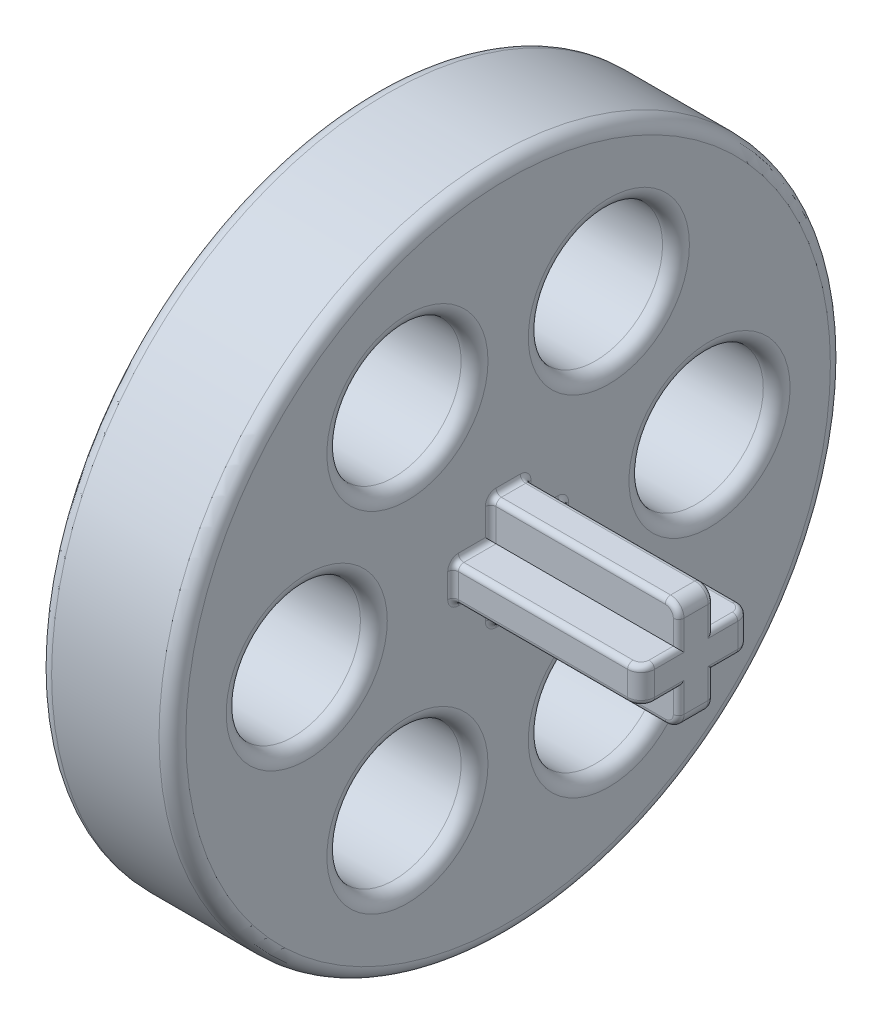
ISO-10303-21;
HEADER;
FILE_DESCRIPTION(('STEP AP214'),'2;1');
FILE_NAME('part.step','',(''),(''),'','','');
FILE_SCHEMA(('AUTOMOTIVE_DESIGN { 1 0 10303 214 1 1 1 1 }'));
ENDSEC;
DATA;
#1=APPLICATION_CONTEXT('core data for automotive mechanical design processes');
#2=APPLICATION_PROTOCOL_DEFINITION('international standard','automotive_design',2000,#1);
#3=PRODUCT_CONTEXT('',#1,'mechanical');
#4=PRODUCT('Part','Part','',(#3));
#5=PRODUCT_RELATED_PRODUCT_CATEGORY('part','',(#4));
#6=PRODUCT_DEFINITION_FORMATION('','',#4);
#7=PRODUCT_DEFINITION_CONTEXT('part definition',#1,'design');
#8=PRODUCT_DEFINITION('design','',#6,#7);
#9=PRODUCT_DEFINITION_SHAPE('','',#8);
#10=(LENGTH_UNIT() NAMED_UNIT(*) SI_UNIT(.MILLI.,.METRE.));
#11=(NAMED_UNIT(*) PLANE_ANGLE_UNIT() SI_UNIT($,.RADIAN.));
#12=(NAMED_UNIT(*) SI_UNIT($,.STERADIAN.) SOLID_ANGLE_UNIT());
#13=UNCERTAINTY_MEASURE_WITH_UNIT(LENGTH_MEASURE(1.E-05),#10,'distance_accuracy_value','');
#14=(GEOMETRIC_REPRESENTATION_CONTEXT(3) GLOBAL_UNCERTAINTY_ASSIGNED_CONTEXT((#13)) GLOBAL_UNIT_ASSIGNED_CONTEXT((#10,
#11,#12)) REPRESENTATION_CONTEXT('',''));
#15=CARTESIAN_POINT('',(0.,0.,0.));
#16=DIRECTION('',(0.,0.,1.));
#17=DIRECTION('',(1.,0.,0.));
#18=AXIS2_PLACEMENT_3D('',#15,#16,#17);
#19=CARTESIAN_POINT('',(5.,0.,0.));
#20=DIRECTION('',(1.,0.,0.));
#21=DIRECTION('',(0.,0.,-1.));
#22=AXIS2_PLACEMENT_3D('',#19,#20,#21);
#23=PLANE('',#22);
#24=CARTESIAN_POINT('',(5.,6.49519052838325,-3.75000000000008));
#25=DIRECTION('',(1.,0.,0.));
#26=DIRECTION('',(0.,0.,-1.));
#27=AXIS2_PLACEMENT_3D('',#24,#25,#26);
#28=CIRCLE('',#27,3.);
#29=CARTESIAN_POINT('',(5.,6.49519052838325,-6.75000000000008));
#30=VERTEX_POINT('',#29);
#31=EDGE_CURVE('E476',#30,#30,#28,.F.);
#32=ORIENTED_EDGE('',*,*,#31,.T.);
#33=EDGE_LOOP('',(#32));
#34=FACE_BOUND('',#33,.T.);
#35=CARTESIAN_POINT('',(5.,0.,7.5));
#36=DIRECTION('',(1.,0.,0.));
#37=DIRECTION('',(0.,0.,-1.));
#38=AXIS2_PLACEMENT_3D('',#35,#36,#37);
#39=CIRCLE('',#38,3.);
#40=CARTESIAN_POINT('',(5.,0.,4.5));
#41=VERTEX_POINT('',#40);
#42=EDGE_CURVE('E473',#41,#41,#39,.F.);
#43=ORIENTED_EDGE('',*,*,#42,.T.);
#44=EDGE_LOOP('',(#43));
#45=FACE_BOUND('',#44,.T.);
#46=CARTESIAN_POINT('',(5.,-6.4951905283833,-3.74999999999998));
#47=DIRECTION('',(1.,0.,0.));
#48=DIRECTION('',(0.,0.,-1.));
#49=AXIS2_PLACEMENT_3D('',#46,#47,#48);
#50=CIRCLE('',#49,3.);
#51=CARTESIAN_POINT('',(5.,-6.4951905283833,-6.74999999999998));
#52=VERTEX_POINT('',#51);
#53=EDGE_CURVE('E470',#52,#52,#50,.F.);
#54=ORIENTED_EDGE('',*,*,#53,.T.);
#55=EDGE_LOOP('',(#54));
#56=FACE_BOUND('',#55,.T.);
#57=CARTESIAN_POINT('',(5.,0.,0.));
#58=DIRECTION('',(1.,0.,0.));
#59=DIRECTION('',(0.,0.,-1.));
#60=AXIS2_PLACEMENT_3D('',#57,#58,#59);
#61=CIRCLE('',#60,12.);
#62=CARTESIAN_POINT('',(5.,0.,-12.));
#63=VERTEX_POINT('',#62);
#64=EDGE_CURVE('E467',#63,#63,#61,.T.);
#65=ORIENTED_EDGE('',*,*,#64,.T.);
#66=EDGE_LOOP('',(#65));
#67=FACE_BOUND('',#66,.T.);
#68=CARTESIAN_POINT('',(5.,0.,-7.5));
#69=DIRECTION('',(1.,0.,0.));
#70=DIRECTION('',(0.,0.,-1.));
#71=AXIS2_PLACEMENT_3D('',#68,#69,#70);
#72=CIRCLE('',#71,3.);
#73=CARTESIAN_POINT('',(5.,0.,-10.5));
#74=VERTEX_POINT('',#73);
#75=EDGE_CURVE('E464',#74,#74,#72,.F.);
#76=ORIENTED_EDGE('',*,*,#75,.T.);
#77=EDGE_LOOP('',(#76));
#78=FACE_BOUND('',#77,.T.);
#79=CARTESIAN_POINT('',(5.,-6.49519052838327,3.75000000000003));
#80=DIRECTION('',(1.,0.,0.));
#81=DIRECTION('',(0.,0.,-1.));
#82=AXIS2_PLACEMENT_3D('',#79,#80,#81);
#83=CIRCLE('',#82,3.);
#84=CARTESIAN_POINT('',(5.,-6.49519052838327,0.75000000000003));
#85=VERTEX_POINT('',#84);
#86=EDGE_CURVE('E461',#85,#85,#83,.F.);
#87=ORIENTED_EDGE('',*,*,#86,.T.);
#88=EDGE_LOOP('',(#87));
#89=FACE_BOUND('',#88,.T.);
#90=CARTESIAN_POINT('',(5.,6.49519052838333,3.74999999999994));
#91=DIRECTION('',(1.,0.,0.));
#92=DIRECTION('',(0.,0.,-1.));
#93=AXIS2_PLACEMENT_3D('',#90,#91,#92);
#94=CIRCLE('',#93,3.);
#95=CARTESIAN_POINT('',(5.,6.49519052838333,0.74999999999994));
#96=VERTEX_POINT('',#95);
#97=EDGE_CURVE('E458',#96,#96,#94,.F.);
#98=ORIENTED_EDGE('',*,*,#97,.T.);
#99=EDGE_LOOP('',(#98));
#100=FACE_BOUND('',#99,.T.);
#101=DIRECTION('',(0.,0.,1.));
#102=VECTOR('',#101,1.);
#103=CARTESIAN_POINT('',(5.,0.85,0.));
#104=LINE('',#103,#102);
#105=CARTESIAN_POINT('',(5.,0.85,-0.85));
#106=VERTEX_POINT('',#105);
#107=CARTESIAN_POINT('',(5.,0.85,-1.85));
#108=VERTEX_POINT('',#107);
#109=EDGE_CURVE('E1454',#106,#108,#104,.F.);
#110=ORIENTED_EDGE('',*,*,#109,.T.);
#111=CARTESIAN_POINT('',(5.,0.45,-1.85));
#112=DIRECTION('',(1.,0.,0.));
#113=DIRECTION('',(0.,0.,-1.));
#114=AXIS2_PLACEMENT_3D('',#111,#112,#113);
#115=CIRCLE('',#114,0.4);
#116=CARTESIAN_POINT('',(5.,0.45,-2.25));
#117=VERTEX_POINT('',#116);
#118=EDGE_CURVE('E1460',#108,#117,#115,.F.);
#119=ORIENTED_EDGE('',*,*,#118,.T.);
#120=DIRECTION('',(0.,1.,0.));
#121=VECTOR('',#120,1.);
#122=CARTESIAN_POINT('',(5.,0.,-2.25));
#123=LINE('',#122,#121);
#124=CARTESIAN_POINT('',(5.,-0.45,-2.25));
#125=VERTEX_POINT('',#124);
#126=EDGE_CURVE('E1458',#117,#125,#123,.F.);
#127=ORIENTED_EDGE('',*,*,#126,.T.);
#128=CARTESIAN_POINT('',(5.,-0.45,-1.85));
#129=DIRECTION('',(1.,0.,0.));
#130=DIRECTION('',(0.,0.,-1.));
#131=AXIS2_PLACEMENT_3D('',#128,#129,#130);
#132=CIRCLE('',#131,0.4);
#133=CARTESIAN_POINT('',(5.,-0.85,-1.85));
#134=VERTEX_POINT('',#133);
#135=EDGE_CURVE('E1456',#125,#134,#132,.F.);
#136=ORIENTED_EDGE('',*,*,#135,.T.);
#137=DIRECTION('',(0.,0.,-1.));
#138=VECTOR('',#137,1.);
#139=CARTESIAN_POINT('',(5.,-0.85,0.));
#140=LINE('',#139,#138);
#141=CARTESIAN_POINT('',(5.,-0.85,-0.85));
#142=VERTEX_POINT('',#141);
#143=EDGE_CURVE('E1447',#134,#142,#140,.F.);
#144=ORIENTED_EDGE('',*,*,#143,.T.);
#145=DIRECTION('',(0.,1.,0.));
#146=VECTOR('',#145,1.);
#147=CARTESIAN_POINT('',(5.,0.,-0.85));
#148=LINE('',#147,#146);
#149=CARTESIAN_POINT('',(5.,-1.85,-0.85));
#150=VERTEX_POINT('',#149);
#151=EDGE_CURVE('E1445',#142,#150,#148,.F.);
#152=ORIENTED_EDGE('',*,*,#151,.T.);
#153=CARTESIAN_POINT('',(5.,-1.85,-0.45));
#154=DIRECTION('',(1.,0.,0.));
#155=DIRECTION('',(0.,0.,-1.));
#156=AXIS2_PLACEMENT_3D('',#153,#154,#155);
#157=CIRCLE('',#156,0.4);
#158=CARTESIAN_POINT('',(5.,-2.25,-0.45));
#159=VERTEX_POINT('',#158);
#160=EDGE_CURVE('E1443',#150,#159,#157,.F.);
#161=ORIENTED_EDGE('',*,*,#160,.T.);
#162=DIRECTION('',(0.,0.,-1.));
#163=VECTOR('',#162,1.);
#164=CARTESIAN_POINT('',(5.,-2.25,0.));
#165=LINE('',#164,#163);
#166=CARTESIAN_POINT('',(5.,-2.25,0.45));
#167=VERTEX_POINT('',#166);
#168=EDGE_CURVE('E1433',#159,#167,#165,.F.);
#169=ORIENTED_EDGE('',*,*,#168,.T.);
#170=CARTESIAN_POINT('',(5.,-1.85,0.45));
#171=DIRECTION('',(1.,0.,0.));
#172=DIRECTION('',(0.,0.,-1.));
#173=AXIS2_PLACEMENT_3D('',#170,#171,#172);
#174=CIRCLE('',#173,0.4);
#175=CARTESIAN_POINT('',(5.,-1.85,0.85));
#176=VERTEX_POINT('',#175);
#177=EDGE_CURVE('E1434',#167,#176,#174,.F.);
#178=ORIENTED_EDGE('',*,*,#177,.T.);
#179=DIRECTION('',(0.,-1.,0.));
#180=VECTOR('',#179,1.);
#181=CARTESIAN_POINT('',(5.,0.,0.85));
#182=LINE('',#181,#180);
#183=CARTESIAN_POINT('',(5.,-0.85,0.85));
#184=VERTEX_POINT('',#183);
#185=EDGE_CURVE('E1633',#176,#184,#182,.F.);
#186=ORIENTED_EDGE('',*,*,#185,.T.);
#187=DIRECTION('',(0.,0.,-1.));
#188=VECTOR('',#187,1.);
#189=CARTESIAN_POINT('',(5.,-0.85,0.));
#190=LINE('',#189,#188);
#191=CARTESIAN_POINT('',(5.,-0.85,1.85));
#192=VERTEX_POINT('',#191);
#193=EDGE_CURVE('E1627',#184,#192,#190,.F.);
#194=ORIENTED_EDGE('',*,*,#193,.T.);
#195=CARTESIAN_POINT('',(5.,-0.45,1.85));
#196=DIRECTION('',(1.,0.,0.));
#197=DIRECTION('',(0.,0.,-1.));
#198=AXIS2_PLACEMENT_3D('',#195,#196,#197);
#199=CIRCLE('',#198,0.4);
#200=CARTESIAN_POINT('',(5.,-0.45,2.25));
#201=VERTEX_POINT('',#200);
#202=EDGE_CURVE('E1625',#192,#201,#199,.F.);
#203=ORIENTED_EDGE('',*,*,#202,.T.);
#204=DIRECTION('',(0.,-1.,0.));
#205=VECTOR('',#204,1.);
#206=CARTESIAN_POINT('',(5.,0.,2.25));
#207=LINE('',#206,#205);
#208=CARTESIAN_POINT('',(5.,0.45,2.25));
#209=VERTEX_POINT('',#208);
#210=EDGE_CURVE('E1623',#201,#209,#207,.F.);
#211=ORIENTED_EDGE('',*,*,#210,.T.);
#212=CARTESIAN_POINT('',(5.,0.45,1.85));
#213=DIRECTION('',(1.,0.,0.));
#214=DIRECTION('',(0.,0.,-1.));
#215=AXIS2_PLACEMENT_3D('',#212,#213,#214);
#216=CIRCLE('',#215,0.4);
#217=CARTESIAN_POINT('',(5.,0.85,1.85));
#218=VERTEX_POINT('',#217);
#219=EDGE_CURVE('E1629',#209,#218,#216,.F.);
#220=ORIENTED_EDGE('',*,*,#219,.T.);
#221=DIRECTION('',(0.,0.,1.));
#222=VECTOR('',#221,1.);
#223=CARTESIAN_POINT('',(5.,0.85,0.));
#224=LINE('',#223,#222);
#225=CARTESIAN_POINT('',(5.,0.85,0.85));
#226=VERTEX_POINT('',#225);
#227=EDGE_CURVE('E1631',#218,#226,#224,.F.);
#228=ORIENTED_EDGE('',*,*,#227,.T.);
#229=DIRECTION('',(0.,-1.,0.));
#230=VECTOR('',#229,1.);
#231=CARTESIAN_POINT('',(5.,0.,0.85));
#232=LINE('',#231,#230);
#233=CARTESIAN_POINT('',(5.,1.85,0.85));
#234=VERTEX_POINT('',#233);
#235=EDGE_CURVE('E1438',#226,#234,#232,.F.);
#236=ORIENTED_EDGE('',*,*,#235,.T.);
#237=CARTESIAN_POINT('',(5.,1.85,0.45));
#238=DIRECTION('',(1.,0.,0.));
#239=DIRECTION('',(0.,0.,-1.));
#240=AXIS2_PLACEMENT_3D('',#237,#238,#239);
#241=CIRCLE('',#240,0.4);
#242=CARTESIAN_POINT('',(5.,2.25,0.45));
#243=VERTEX_POINT('',#242);
#244=EDGE_CURVE('E1430',#234,#243,#241,.F.);
#245=ORIENTED_EDGE('',*,*,#244,.T.);
#246=DIRECTION('',(0.,0.,1.));
#247=VECTOR('',#246,1.);
#248=CARTESIAN_POINT('',(5.,2.25,0.));
#249=LINE('',#248,#247);
#250=CARTESIAN_POINT('',(5.,2.25,-0.45));
#251=VERTEX_POINT('',#250);
#252=EDGE_CURVE('E1436',#243,#251,#249,.F.);
#253=ORIENTED_EDGE('',*,*,#252,.T.);
#254=CARTESIAN_POINT('',(5.,1.85,-0.45));
#255=DIRECTION('',(1.,0.,0.));
#256=DIRECTION('',(0.,0.,-1.));
#257=AXIS2_PLACEMENT_3D('',#254,#255,#256);
#258=CIRCLE('',#257,0.4);
#259=CARTESIAN_POINT('',(5.,1.85,-0.85));
#260=VERTEX_POINT('',#259);
#261=EDGE_CURVE('E1449',#251,#260,#258,.F.);
#262=ORIENTED_EDGE('',*,*,#261,.T.);
#263=DIRECTION('',(0.,1.,0.));
#264=VECTOR('',#263,1.);
#265=CARTESIAN_POINT('',(5.,0.,-0.85));
#266=LINE('',#265,#264);
#267=EDGE_CURVE('E1451',#260,#106,#266,.F.);
#268=ORIENTED_EDGE('',*,*,#267,.T.);
#269=EDGE_LOOP('',(#110,#119,#127,#136,#144,#152,#161,#169,#178,#186,#194,#203,#211,#220,#228,
#236,#245,#253,#262,#268));
#270=FACE_BOUND('',#269,.T.);
#271=ADVANCED_FACE('F37',(#34,#45,#56,#67,#78,#89,#100,#270),#23,.T.);
#272=CARTESIAN_POINT('',(0.,0.,0.));
#273=DIRECTION('',(1.,0.,0.));
#274=DIRECTION('',(0.,0.,-1.));
#275=AXIS2_PLACEMENT_3D('',#272,#273,#274);
#276=PLANE('',#275);
#277=CARTESIAN_POINT('',(0.,6.49519052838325,-3.75000000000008));
#278=DIRECTION('',(1.,0.,0.));
#279=DIRECTION('',(0.,0.,-1.));
#280=AXIS2_PLACEMENT_3D('',#277,#278,#279);
#281=CIRCLE('',#280,3.);
#282=CARTESIAN_POINT('',(0.,6.49519052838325,-6.75000000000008));
#283=VERTEX_POINT('',#282);
#284=EDGE_CURVE('E11',#283,#283,#281,.T.);
#285=ORIENTED_EDGE('',*,*,#284,.T.);
#286=EDGE_LOOP('',(#285));
#287=FACE_BOUND('',#286,.T.);
#288=CARTESIAN_POINT('',(0.,6.49519052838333,3.74999999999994));
#289=DIRECTION('',(1.,0.,0.));
#290=DIRECTION('',(0.,0.,-1.));
#291=AXIS2_PLACEMENT_3D('',#288,#289,#290);
#292=CIRCLE('',#291,3.);
#293=CARTESIAN_POINT('',(0.,6.49519052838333,0.74999999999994));
#294=VERTEX_POINT('',#293);
#295=EDGE_CURVE('E45',#294,#294,#292,.T.);
#296=ORIENTED_EDGE('',*,*,#295,.T.);
#297=EDGE_LOOP('',(#296));
#298=FACE_BOUND('',#297,.T.);
#299=CARTESIAN_POINT('',(0.,0.,7.5));
#300=DIRECTION('',(1.,0.,0.));
#301=DIRECTION('',(0.,0.,-1.));
#302=AXIS2_PLACEMENT_3D('',#299,#300,#301);
#303=CIRCLE('',#302,3.);
#304=CARTESIAN_POINT('',(0.,0.,4.5));
#305=VERTEX_POINT('',#304);
#306=EDGE_CURVE('E527',#305,#305,#303,.T.);
#307=ORIENTED_EDGE('',*,*,#306,.T.);
#308=EDGE_LOOP('',(#307));
#309=FACE_BOUND('',#308,.T.);
#310=CARTESIAN_POINT('',(0.,-6.49519052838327,3.75000000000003));
#311=DIRECTION('',(1.,0.,0.));
#312=DIRECTION('',(0.,0.,-1.));
#313=AXIS2_PLACEMENT_3D('',#310,#311,#312);
#314=CIRCLE('',#313,3.);
#315=CARTESIAN_POINT('',(0.,-6.49519052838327,0.75000000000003));
#316=VERTEX_POINT('',#315);
#317=EDGE_CURVE('E524',#316,#316,#314,.T.);
#318=ORIENTED_EDGE('',*,*,#317,.T.);
#319=EDGE_LOOP('',(#318));
#320=FACE_BOUND('',#319,.T.);
#321=CARTESIAN_POINT('',(0.,-6.4951905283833,-3.74999999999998));
#322=DIRECTION('',(1.,0.,0.));
#323=DIRECTION('',(0.,0.,-1.));
#324=AXIS2_PLACEMENT_3D('',#321,#322,#323);
#325=CIRCLE('',#324,3.);
#326=CARTESIAN_POINT('',(0.,-6.4951905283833,-6.74999999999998));
#327=VERTEX_POINT('',#326);
#328=EDGE_CURVE('E521',#327,#327,#325,.T.);
#329=ORIENTED_EDGE('',*,*,#328,.T.);
#330=EDGE_LOOP('',(#329));
#331=FACE_BOUND('',#330,.T.);
#332=CARTESIAN_POINT('',(0.,0.,-7.5));
#333=DIRECTION('',(1.,0.,0.));
#334=DIRECTION('',(0.,0.,-1.));
#335=AXIS2_PLACEMENT_3D('',#332,#333,#334);
#336=CIRCLE('',#335,3.);
#337=CARTESIAN_POINT('',(0.,0.,-10.5));
#338=VERTEX_POINT('',#337);
#339=EDGE_CURVE('E518',#338,#338,#336,.T.);
#340=ORIENTED_EDGE('',*,*,#339,.T.);
#341=EDGE_LOOP('',(#340));
#342=FACE_BOUND('',#341,.T.);
#343=CARTESIAN_POINT('',(0.,0.,0.));
#344=DIRECTION('',(1.,0.,0.));
#345=DIRECTION('',(0.,0.,-1.));
#346=AXIS2_PLACEMENT_3D('',#343,#344,#345);
#347=CIRCLE('',#346,12.);
#348=CARTESIAN_POINT('',(0.,0.,-12.));
#349=VERTEX_POINT('',#348);
#350=EDGE_CURVE('E515',#349,#349,#347,.F.);
#351=ORIENTED_EDGE('',*,*,#350,.T.);
#352=EDGE_LOOP('',(#351));
#353=FACE_BOUND('',#352,.T.);
#354=ADVANCED_FACE('F532',(#287,#298,#309,#320,#331,#342,#353),#276,.F.);
#355=CARTESIAN_POINT('',(5.,0.,0.));
#356=DIRECTION('',(-1.,0.,0.));
#357=DIRECTION('',(0.,0.,1.));
#358=AXIS2_PLACEMENT_3D('',#355,#356,#357);
#359=CYLINDRICAL_SURFACE('',#358,12.5);
#360=CARTESIAN_POINT('',(4.5,0.,0.));
#361=DIRECTION('',(1.,0.,0.));
#362=DIRECTION('',(0.,0.,-1.));
#363=AXIS2_PLACEMENT_3D('',#360,#361,#362);
#364=CIRCLE('',#363,12.5);
#365=CARTESIAN_POINT('',(4.5,0.,-12.5));
#366=VERTEX_POINT('',#365);
#367=EDGE_CURVE('E494',#366,#366,#364,.F.);
#368=ORIENTED_EDGE('',*,*,#367,.T.);
#369=EDGE_LOOP('',(#368));
#370=FACE_BOUND('',#369,.T.);
#371=CARTESIAN_POINT('',(0.5,0.,0.));
#372=DIRECTION('',(1.,0.,0.));
#373=DIRECTION('',(0.,0.,-1.));
#374=AXIS2_PLACEMENT_3D('',#371,#372,#373);
#375=CIRCLE('',#374,12.5);
#376=CARTESIAN_POINT('',(0.5,0.,-12.5));
#377=VERTEX_POINT('',#376);
#378=EDGE_CURVE('E491',#377,#377,#375,.T.);
#379=ORIENTED_EDGE('',*,*,#378,.T.);
#380=EDGE_LOOP('',(#379));
#381=FACE_BOUND('',#380,.T.);
#382=ADVANCED_FACE('F558',(#370,#381),#359,.T.);
#383=CARTESIAN_POINT('',(5.,0.,-7.5));
#384=DIRECTION('',(-1.,0.,0.));
#385=DIRECTION('',(0.,0.,1.));
#386=AXIS2_PLACEMENT_3D('',#383,#384,#385);
#387=CYLINDRICAL_SURFACE('',#386,2.5);
#388=CARTESIAN_POINT('',(4.5,0.,-7.5));
#389=DIRECTION('',(1.,0.,0.));
#390=DIRECTION('',(0.,0.,-1.));
#391=AXIS2_PLACEMENT_3D('',#388,#389,#390);
#392=CIRCLE('',#391,2.5);
#393=CARTESIAN_POINT('',(4.5,0.,-10.));
#394=VERTEX_POINT('',#393);
#395=EDGE_CURVE('E500',#394,#394,#392,.T.);
#396=ORIENTED_EDGE('',*,*,#395,.T.);
#397=EDGE_LOOP('',(#396));
#398=FACE_BOUND('',#397,.T.);
#399=CARTESIAN_POINT('',(0.5,0.,-7.5));
#400=DIRECTION('',(1.,0.,0.));
#401=DIRECTION('',(0.,0.,-1.));
#402=AXIS2_PLACEMENT_3D('',#399,#400,#401);
#403=CIRCLE('',#402,2.5);
#404=CARTESIAN_POINT('',(0.5,0.,-10.));
#405=VERTEX_POINT('',#404);
#406=EDGE_CURVE('E497',#405,#405,#403,.F.);
#407=ORIENTED_EDGE('',*,*,#406,.T.);
#408=EDGE_LOOP('',(#407));
#409=FACE_BOUND('',#408,.T.);
#410=ADVANCED_FACE('F563',(#398,#409),#387,.F.);
#411=CARTESIAN_POINT('',(5.,-6.4951905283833,-3.74999999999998));
#412=DIRECTION('',(-1.,0.,0.));
#413=DIRECTION('',(0.,0.,1.));
#414=AXIS2_PLACEMENT_3D('',#411,#412,#413);
#415=CYLINDRICAL_SURFACE('',#414,2.5);
#416=CARTESIAN_POINT('',(4.5,-6.4951905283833,-3.74999999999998));
#417=DIRECTION('',(1.,0.,0.));
#418=DIRECTION('',(0.,0.,-1.));
#419=AXIS2_PLACEMENT_3D('',#416,#417,#418);
#420=CIRCLE('',#419,2.5);
#421=CARTESIAN_POINT('',(4.5,-6.4951905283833,-6.24999999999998));
#422=VERTEX_POINT('',#421);
#423=EDGE_CURVE('E488',#422,#422,#420,.T.);
#424=ORIENTED_EDGE('',*,*,#423,.T.);
#425=EDGE_LOOP('',(#424));
#426=FACE_BOUND('',#425,.T.);
#427=CARTESIAN_POINT('',(0.5,-6.4951905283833,-3.74999999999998));
#428=DIRECTION('',(1.,0.,0.));
#429=DIRECTION('',(0.,0.,-1.));
#430=AXIS2_PLACEMENT_3D('',#427,#428,#429);
#431=CIRCLE('',#430,2.5);
#432=CARTESIAN_POINT('',(0.5,-6.4951905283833,-6.24999999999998));
#433=VERTEX_POINT('',#432);
#434=EDGE_CURVE('E485',#433,#433,#431,.F.);
#435=ORIENTED_EDGE('',*,*,#434,.T.);
#436=EDGE_LOOP('',(#435));
#437=FACE_BOUND('',#436,.T.);
#438=ADVANCED_FACE('F806',(#426,#437),#415,.F.);
#439=CARTESIAN_POINT('',(5.,-6.49519052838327,3.75000000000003));
#440=DIRECTION('',(-1.,0.,0.));
#441=DIRECTION('',(0.,0.,1.));
#442=AXIS2_PLACEMENT_3D('',#439,#440,#441);
#443=CYLINDRICAL_SURFACE('',#442,2.5);
#444=CARTESIAN_POINT('',(4.5,-6.49519052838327,3.75000000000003));
#445=DIRECTION('',(1.,0.,0.));
#446=DIRECTION('',(0.,0.,-1.));
#447=AXIS2_PLACEMENT_3D('',#444,#445,#446);
#448=CIRCLE('',#447,2.5);
#449=CARTESIAN_POINT('',(4.5,-6.49519052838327,1.25000000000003));
#450=VERTEX_POINT('',#449);
#451=EDGE_CURVE('E506',#450,#450,#448,.T.);
#452=ORIENTED_EDGE('',*,*,#451,.T.);
#453=EDGE_LOOP('',(#452));
#454=FACE_BOUND('',#453,.T.);
#455=CARTESIAN_POINT('',(0.5,-6.49519052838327,3.75000000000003));
#456=DIRECTION('',(1.,0.,0.));
#457=DIRECTION('',(0.,0.,-1.));
#458=AXIS2_PLACEMENT_3D('',#455,#456,#457);
#459=CIRCLE('',#458,2.5);
#460=CARTESIAN_POINT('',(0.5,-6.49519052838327,1.25000000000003));
#461=VERTEX_POINT('',#460);
#462=EDGE_CURVE('E503',#461,#461,#459,.F.);
#463=ORIENTED_EDGE('',*,*,#462,.T.);
#464=EDGE_LOOP('',(#463));
#465=FACE_BOUND('',#464,.T.);
#466=ADVANCED_FACE('F800',(#454,#465),#443,.F.);
#467=CARTESIAN_POINT('',(5.,0.,7.5));
#468=DIRECTION('',(-1.,0.,0.));
#469=DIRECTION('',(0.,0.,1.));
#470=AXIS2_PLACEMENT_3D('',#467,#468,#469);
#471=CYLINDRICAL_SURFACE('',#470,2.5);
#472=CARTESIAN_POINT('',(4.5,0.,7.5));
#473=DIRECTION('',(1.,0.,0.));
#474=DIRECTION('',(0.,0.,-1.));
#475=AXIS2_PLACEMENT_3D('',#472,#473,#474);
#476=CIRCLE('',#475,2.5);
#477=CARTESIAN_POINT('',(4.5,0.,5.));
#478=VERTEX_POINT('',#477);
#479=EDGE_CURVE('E482',#478,#478,#476,.T.);
#480=ORIENTED_EDGE('',*,*,#479,.T.);
#481=EDGE_LOOP('',(#480));
#482=FACE_BOUND('',#481,.T.);
#483=CARTESIAN_POINT('',(0.5,0.,7.5));
#484=DIRECTION('',(1.,0.,0.));
#485=DIRECTION('',(0.,0.,-1.));
#486=AXIS2_PLACEMENT_3D('',#483,#484,#485);
#487=CIRCLE('',#486,2.5);
#488=CARTESIAN_POINT('',(0.5,0.,5.));
#489=VERTEX_POINT('',#488);
#490=EDGE_CURVE('E479',#489,#489,#487,.F.);
#491=ORIENTED_EDGE('',*,*,#490,.T.);
#492=EDGE_LOOP('',(#491));
#493=FACE_BOUND('',#492,.T.);
#494=ADVANCED_FACE('F791',(#482,#493),#471,.F.);
#495=CARTESIAN_POINT('',(5.,6.49519052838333,3.74999999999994));
#496=DIRECTION('',(-1.,0.,0.));
#497=DIRECTION('',(0.,0.,1.));
#498=AXIS2_PLACEMENT_3D('',#495,#496,#497);
#499=CYLINDRICAL_SURFACE('',#498,2.5);
#500=CARTESIAN_POINT('',(4.5,6.49519052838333,3.74999999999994));
#501=DIRECTION('',(1.,0.,0.));
#502=DIRECTION('',(0.,0.,-1.));
#503=AXIS2_PLACEMENT_3D('',#500,#501,#502);
#504=CIRCLE('',#503,2.5);
#505=CARTESIAN_POINT('',(4.5,6.49519052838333,1.24999999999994));
#506=VERTEX_POINT('',#505);
#507=EDGE_CURVE('E512',#506,#506,#504,.T.);
#508=ORIENTED_EDGE('',*,*,#507,.T.);
#509=EDGE_LOOP('',(#508));
#510=FACE_BOUND('',#509,.T.);
#511=CARTESIAN_POINT('',(0.5,6.49519052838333,3.74999999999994));
#512=DIRECTION('',(1.,0.,0.));
#513=DIRECTION('',(0.,0.,-1.));
#514=AXIS2_PLACEMENT_3D('',#511,#512,#513);
#515=CIRCLE('',#514,2.5);
#516=CARTESIAN_POINT('',(0.5,6.49519052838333,1.24999999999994));
#517=VERTEX_POINT('',#516);
#518=EDGE_CURVE('E509',#517,#517,#515,.F.);
#519=ORIENTED_EDGE('',*,*,#518,.T.);
#520=EDGE_LOOP('',(#519));
#521=FACE_BOUND('',#520,.T.);
#522=ADVANCED_FACE('F787',(#510,#521),#499,.F.);
#523=CARTESIAN_POINT('',(5.,6.49519052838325,-3.75000000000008));
#524=DIRECTION('',(-1.,0.,0.));
#525=DIRECTION('',(0.,0.,1.));
#526=AXIS2_PLACEMENT_3D('',#523,#524,#525);
#527=CYLINDRICAL_SURFACE('',#526,2.5);
#528=CARTESIAN_POINT('',(4.5,6.49519052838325,-3.75000000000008));
#529=DIRECTION('',(1.,0.,0.));
#530=DIRECTION('',(0.,0.,-1.));
#531=AXIS2_PLACEMENT_3D('',#528,#529,#530);
#532=CIRCLE('',#531,2.5);
#533=CARTESIAN_POINT('',(4.5,6.49519052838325,-6.25000000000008));
#534=VERTEX_POINT('',#533);
#535=EDGE_CURVE('E455',#534,#534,#532,.T.);
#536=ORIENTED_EDGE('',*,*,#535,.T.);
#537=EDGE_LOOP('',(#536));
#538=FACE_BOUND('',#537,.T.);
#539=CARTESIAN_POINT('',(0.5,6.49519052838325,-3.75000000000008));
#540=DIRECTION('',(1.,0.,0.));
#541=DIRECTION('',(0.,0.,-1.));
#542=AXIS2_PLACEMENT_3D('',#539,#540,#541);
#543=CIRCLE('',#542,2.5);
#544=CARTESIAN_POINT('',(0.5,6.49519052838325,-6.25000000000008));
#545=VERTEX_POINT('',#544);
#546=EDGE_CURVE('E361',#545,#545,#543,.F.);
#547=ORIENTED_EDGE('',*,*,#546,.T.);
#548=EDGE_LOOP('',(#547));
#549=FACE_BOUND('',#548,.T.);
#550=ADVANCED_FACE('F790',(#538,#549),#527,.F.);
#551=CARTESIAN_POINT('',(12.,0.65,0.65));
#552=DIRECTION('',(0.,0.,-1.));
#553=DIRECTION('',(-1.,0.,0.));
#554=AXIS2_PLACEMENT_3D('',#551,#552,#553);
#555=PLANE('',#554);
#556=DIRECTION('',(-1.,0.,0.));
#557=VECTOR('',#556,1.);
#558=CARTESIAN_POINT('',(12.,1.85,0.65));
#559=LINE('',#558,#557);
#560=CARTESIAN_POINT('',(11.5,1.85,0.65));
#561=VERTEX_POINT('',#560);
#562=CARTESIAN_POINT('',(5.2,1.85,0.65));
#563=VERTEX_POINT('',#562);
#564=EDGE_CURVE('E304',#561,#563,#559,.T.);
#565=ORIENTED_EDGE('',*,*,#564,.T.);
#566=DIRECTION('',(0.,-1.,0.));
#567=VECTOR('',#566,1.);
#568=CARTESIAN_POINT('',(5.2,0.65,0.65));
#569=LINE('',#568,#567);
#570=CARTESIAN_POINT('',(5.2,0.65,0.65));
#571=VERTEX_POINT('',#570);
#572=EDGE_CURVE('E309',#563,#571,#569,.T.);
#573=ORIENTED_EDGE('',*,*,#572,.T.);
#574=DIRECTION('',(-1.,0.,0.));
#575=VECTOR('',#574,1.);
#576=CARTESIAN_POINT('',(12.,0.65,0.65));
#577=LINE('',#576,#575);
#578=CARTESIAN_POINT('',(11.8,0.65,0.65));
#579=VERTEX_POINT('',#578);
#580=EDGE_CURVE('E1571',#579,#571,#577,.T.);
#581=ORIENTED_EDGE('',*,*,#580,.F.);
#582=DIRECTION('',(0.,-1.,0.));
#583=VECTOR('',#582,1.);
#584=CARTESIAN_POINT('',(11.8,0.65,0.65));
#585=LINE('',#584,#583);
#586=CARTESIAN_POINT('',(11.8,1.55,0.65));
#587=VERTEX_POINT('',#586);
#588=EDGE_CURVE('E1427',#579,#587,#585,.F.);
#589=ORIENTED_EDGE('',*,*,#588,.T.);
#590=CARTESIAN_POINT('',(11.5,1.55,0.65));
#591=DIRECTION('',(0.,0.,-1.));
#592=DIRECTION('',(-1.,0.,0.));
#593=AXIS2_PLACEMENT_3D('',#590,#591,#592);
#594=CIRCLE('',#593,0.3);
#595=EDGE_CURVE('E1420',#587,#561,#594,.F.);
#596=ORIENTED_EDGE('',*,*,#595,.T.);
#597=EDGE_LOOP('',(#565,#573,#581,#589,#596));
#598=FACE_BOUND('',#597,.T.);
#599=ADVANCED_FACE('F797',(#598),#555,.F.);
#600=CARTESIAN_POINT('',(12.,0.65,2.05));
#601=DIRECTION('',(0.,-1.,0.));
#602=DIRECTION('',(0.,0.,-1.));
#603=AXIS2_PLACEMENT_3D('',#600,#601,#602);
#604=PLANE('',#603);
#605=ORIENTED_EDGE('',*,*,#580,.T.);
#606=DIRECTION('',(0.,0.,1.));
#607=VECTOR('',#606,1.);
#608=CARTESIAN_POINT('',(5.2,0.65,2.05));
#609=LINE('',#608,#607);
#610=CARTESIAN_POINT('',(5.2,0.65,1.85));
#611=VERTEX_POINT('',#610);
#612=EDGE_CURVE('E1516',#571,#611,#609,.T.);
#613=ORIENTED_EDGE('',*,*,#612,.T.);
#614=DIRECTION('',(-1.,0.,0.));
#615=VECTOR('',#614,1.);
#616=CARTESIAN_POINT('',(12.,0.65,1.85));
#617=LINE('',#616,#615);
#618=CARTESIAN_POINT('',(11.5,0.65,1.85));
#619=VERTEX_POINT('',#618);
#620=EDGE_CURVE('E1421',#611,#619,#617,.F.);
#621=ORIENTED_EDGE('',*,*,#620,.T.);
#622=CARTESIAN_POINT('',(11.5,0.65,1.55));
#623=DIRECTION('',(0.,-1.,0.));
#624=DIRECTION('',(0.,0.,-1.));
#625=AXIS2_PLACEMENT_3D('',#622,#623,#624);
#626=CIRCLE('',#625,0.3);
#627=CARTESIAN_POINT('',(11.8,0.65,1.55));
#628=VERTEX_POINT('',#627);
#629=EDGE_CURVE('E1514',#619,#628,#626,.F.);
#630=ORIENTED_EDGE('',*,*,#629,.T.);
#631=DIRECTION('',(0.,0.,1.));
#632=VECTOR('',#631,1.);
#633=CARTESIAN_POINT('',(11.8,0.65,2.05));
#634=LINE('',#633,#632);
#635=EDGE_CURVE('E1512',#628,#579,#634,.F.);
#636=ORIENTED_EDGE('',*,*,#635,.T.);
#637=EDGE_LOOP('',(#605,#613,#621,#630,#636));
#638=FACE_BOUND('',#637,.T.);
#639=ADVANCED_FACE('F1285',(#638),#604,.F.);
#640=CARTESIAN_POINT('',(12.,-0.65,2.05));
#641=DIRECTION('',(0.,0.,-1.));
#642=DIRECTION('',(-1.,0.,0.));
#643=AXIS2_PLACEMENT_3D('',#640,#641,#642);
#644=PLANE('',#643);
#645=DIRECTION('',(-1.,0.,0.));
#646=VECTOR('',#645,1.);
#647=CARTESIAN_POINT('',(12.,0.45,2.05));
#648=LINE('',#647,#646);
#649=CARTESIAN_POINT('',(11.5,0.45,2.05));
#650=VERTEX_POINT('',#649);
#651=CARTESIAN_POINT('',(5.2,0.45,2.05));
#652=VERTEX_POINT('',#651);
#653=EDGE_CURVE('E1558',#650,#652,#648,.T.);
#654=ORIENTED_EDGE('',*,*,#653,.T.);
#655=DIRECTION('',(0.,-1.,0.));
#656=VECTOR('',#655,1.);
#657=CARTESIAN_POINT('',(5.2,-0.65,2.05));
#658=LINE('',#657,#656);
#659=CARTESIAN_POINT('',(5.2,-0.45,2.05));
#660=VERTEX_POINT('',#659);
#661=EDGE_CURVE('E359',#652,#660,#658,.T.);
#662=ORIENTED_EDGE('',*,*,#661,.T.);
#663=DIRECTION('',(-1.,0.,0.));
#664=VECTOR('',#663,1.);
#665=CARTESIAN_POINT('',(12.,-0.45,2.05));
#666=LINE('',#665,#664);
#667=CARTESIAN_POINT('',(11.5,-0.45,2.05));
#668=VERTEX_POINT('',#667);
#669=EDGE_CURVE('E1561',#660,#668,#666,.F.);
#670=ORIENTED_EDGE('',*,*,#669,.T.);
#671=DIRECTION('',(0.,-1.,0.));
#672=VECTOR('',#671,1.);
#673=CARTESIAN_POINT('',(11.5,-0.65,2.05));
#674=LINE('',#673,#672);
#675=EDGE_CURVE('E330',#668,#650,#674,.F.);
#676=ORIENTED_EDGE('',*,*,#675,.T.);
#677=EDGE_LOOP('',(#654,#662,#670,#676));
#678=FACE_BOUND('',#677,.T.);
#679=ADVANCED_FACE('F1276',(#678),#644,.F.);
#680=CARTESIAN_POINT('',(12.,-0.65,0.65));
#681=DIRECTION('',(0.,1.,0.));
#682=DIRECTION('',(0.,0.,1.));
#683=AXIS2_PLACEMENT_3D('',#680,#681,#682);
#684=PLANE('',#683);
#685=DIRECTION('',(-1.,0.,0.));
#686=VECTOR('',#685,1.);
#687=CARTESIAN_POINT('',(12.,-0.65,1.85));
#688=LINE('',#687,#686);
#689=CARTESIAN_POINT('',(11.5,-0.65,1.85));
#690=VERTEX_POINT('',#689);
#691=CARTESIAN_POINT('',(5.2,-0.65,1.85));
#692=VERTEX_POINT('',#691);
#693=EDGE_CURVE('E1567',#690,#692,#688,.T.);
#694=ORIENTED_EDGE('',*,*,#693,.T.);
#695=DIRECTION('',(0.,0.,-1.));
#696=VECTOR('',#695,1.);
#697=CARTESIAN_POINT('',(5.2,-0.65,0.65));
#698=LINE('',#697,#696);
#699=CARTESIAN_POINT('',(5.2,-0.65,0.65));
#700=VERTEX_POINT('',#699);
#701=EDGE_CURVE('E1526',#692,#700,#698,.T.);
#702=ORIENTED_EDGE('',*,*,#701,.T.);
#703=DIRECTION('',(-1.,0.,0.));
#704=VECTOR('',#703,1.);
#705=CARTESIAN_POINT('',(12.,-0.65,0.65));
#706=LINE('',#705,#704);
#707=CARTESIAN_POINT('',(11.8,-0.65,0.65));
#708=VERTEX_POINT('',#707);
#709=EDGE_CURVE('E1651',#708,#700,#706,.T.);
#710=ORIENTED_EDGE('',*,*,#709,.F.);
#711=DIRECTION('',(0.,0.,-1.));
#712=VECTOR('',#711,1.);
#713=CARTESIAN_POINT('',(11.8,-0.65,0.65));
#714=LINE('',#713,#712);
#715=CARTESIAN_POINT('',(11.8,-0.65,1.55));
#716=VERTEX_POINT('',#715);
#717=EDGE_CURVE('E1522',#708,#716,#714,.F.);
#718=ORIENTED_EDGE('',*,*,#717,.T.);
#719=CARTESIAN_POINT('',(11.5,-0.65,1.55));
#720=DIRECTION('',(0.,1.,0.));
#721=DIRECTION('',(0.,0.,1.));
#722=AXIS2_PLACEMENT_3D('',#719,#720,#721);
#723=CIRCLE('',#722,0.3);
#724=EDGE_CURVE('E1524',#716,#690,#723,.F.);
#725=ORIENTED_EDGE('',*,*,#724,.T.);
#726=EDGE_LOOP('',(#694,#702,#710,#718,#725));
#727=FACE_BOUND('',#726,.T.);
#728=ADVANCED_FACE('F1267',(#727),#684,.F.);
#729=CARTESIAN_POINT('',(12.,-2.05,0.65));
#730=DIRECTION('',(0.,0.,-1.));
#731=DIRECTION('',(-1.,0.,0.));
#732=AXIS2_PLACEMENT_3D('',#729,#730,#731);
#733=PLANE('',#732);
#734=ORIENTED_EDGE('',*,*,#709,.T.);
#735=DIRECTION('',(0.,-1.,0.));
#736=VECTOR('',#735,1.);
#737=CARTESIAN_POINT('',(5.2,-2.05,0.65));
#738=LINE('',#737,#736);
#739=CARTESIAN_POINT('',(5.2,-1.85,0.65));
#740=VERTEX_POINT('',#739);
#741=EDGE_CURVE('E1495',#700,#740,#738,.T.);
#742=ORIENTED_EDGE('',*,*,#741,.T.);
#743=DIRECTION('',(-1.,0.,0.));
#744=VECTOR('',#743,1.);
#745=CARTESIAN_POINT('',(12.,-1.85,0.65));
#746=LINE('',#745,#744);
#747=CARTESIAN_POINT('',(11.5,-1.85,0.65));
#748=VERTEX_POINT('',#747);
#749=EDGE_CURVE('E1600',#740,#748,#746,.F.);
#750=ORIENTED_EDGE('',*,*,#749,.T.);
#751=CARTESIAN_POINT('',(11.5,-1.55,0.65));
#752=DIRECTION('',(0.,0.,-1.));
#753=DIRECTION('',(-1.,0.,0.));
#754=AXIS2_PLACEMENT_3D('',#751,#752,#753);
#755=CIRCLE('',#754,0.3);
#756=CARTESIAN_POINT('',(11.8,-1.55,0.65));
#757=VERTEX_POINT('',#756);
#758=EDGE_CURVE('E1493',#748,#757,#755,.F.);
#759=ORIENTED_EDGE('',*,*,#758,.T.);
#760=DIRECTION('',(0.,-1.,0.));
#761=VECTOR('',#760,1.);
#762=CARTESIAN_POINT('',(11.8,-2.05,0.65));
#763=LINE('',#762,#761);
#764=EDGE_CURVE('E1491',#757,#708,#763,.F.);
#765=ORIENTED_EDGE('',*,*,#764,.T.);
#766=EDGE_LOOP('',(#734,#742,#750,#759,#765));
#767=FACE_BOUND('',#766,.T.);
#768=ADVANCED_FACE('F1258',(#767),#733,.F.);
#769=CARTESIAN_POINT('',(12.,-2.05,-0.65));
#770=DIRECTION('',(0.,1.,0.));
#771=DIRECTION('',(0.,0.,1.));
#772=AXIS2_PLACEMENT_3D('',#769,#770,#771);
#773=PLANE('',#772);
#774=DIRECTION('',(-1.,0.,0.));
#775=VECTOR('',#774,1.);
#776=CARTESIAN_POINT('',(12.,-2.05,0.45));
#777=LINE('',#776,#775);
#778=CARTESIAN_POINT('',(11.5,-2.05,0.45));
#779=VERTEX_POINT('',#778);
#780=CARTESIAN_POINT('',(5.2,-2.05,0.45));
#781=VERTEX_POINT('',#780);
#782=EDGE_CURVE('E1594',#779,#781,#777,.T.);
#783=ORIENTED_EDGE('',*,*,#782,.T.);
#784=DIRECTION('',(0.,0.,-1.));
#785=VECTOR('',#784,1.);
#786=CARTESIAN_POINT('',(5.2,-2.05,-0.65));
#787=LINE('',#786,#785);
#788=CARTESIAN_POINT('',(5.2,-2.05,-0.45));
#789=VERTEX_POINT('',#788);
#790=EDGE_CURVE('E353',#781,#789,#787,.T.);
#791=ORIENTED_EDGE('',*,*,#790,.T.);
#792=DIRECTION('',(-1.,0.,0.));
#793=VECTOR('',#792,1.);
#794=CARTESIAN_POINT('',(12.,-2.05,-0.45));
#795=LINE('',#794,#793);
#796=CARTESIAN_POINT('',(11.5,-2.05,-0.45));
#797=VERTEX_POINT('',#796);
#798=EDGE_CURVE('E1597',#789,#797,#795,.F.);
#799=ORIENTED_EDGE('',*,*,#798,.T.);
#800=DIRECTION('',(0.,0.,-1.));
#801=VECTOR('',#800,1.);
#802=CARTESIAN_POINT('',(11.5,-2.05,-0.65));
#803=LINE('',#802,#801);
#804=EDGE_CURVE('E1613',#797,#779,#803,.F.);
#805=ORIENTED_EDGE('',*,*,#804,.T.);
#806=EDGE_LOOP('',(#783,#791,#799,#805));
#807=FACE_BOUND('',#806,.T.);
#808=ADVANCED_FACE('F1249',(#807),#773,.F.);
#809=CARTESIAN_POINT('',(12.,-0.65,-0.65));
#810=DIRECTION('',(0.,0.,1.));
#811=DIRECTION('',(1.,0.,0.));
#812=AXIS2_PLACEMENT_3D('',#809,#810,#811);
#813=PLANE('',#812);
#814=DIRECTION('',(-1.,0.,0.));
#815=VECTOR('',#814,1.);
#816=CARTESIAN_POINT('',(12.,-1.85,-0.65));
#817=LINE('',#816,#815);
#818=CARTESIAN_POINT('',(11.5,-1.85,-0.65));
#819=VERTEX_POINT('',#818);
#820=CARTESIAN_POINT('',(5.2,-1.85,-0.65));
#821=VERTEX_POINT('',#820);
#822=EDGE_CURVE('E1591',#819,#821,#817,.T.);
#823=ORIENTED_EDGE('',*,*,#822,.T.);
#824=DIRECTION('',(0.,1.,0.));
#825=VECTOR('',#824,1.);
#826=CARTESIAN_POINT('',(5.2,-0.65,-0.65));
#827=LINE('',#826,#825);
#828=CARTESIAN_POINT('',(5.2,-0.65,-0.65));
#829=VERTEX_POINT('',#828);
#830=EDGE_CURVE('E1506',#821,#829,#827,.T.);
#831=ORIENTED_EDGE('',*,*,#830,.T.);
#832=DIRECTION('',(-1.,0.,0.));
#833=VECTOR('',#832,1.);
#834=CARTESIAN_POINT('',(12.,-0.65,-0.65));
#835=LINE('',#834,#833);
#836=CARTESIAN_POINT('',(11.8,-0.65,-0.65));
#837=VERTEX_POINT('',#836);
#838=EDGE_CURVE('E1656',#837,#829,#835,.T.);
#839=ORIENTED_EDGE('',*,*,#838,.F.);
#840=DIRECTION('',(0.,1.,0.));
#841=VECTOR('',#840,1.);
#842=CARTESIAN_POINT('',(11.8,-0.65,-0.65));
#843=LINE('',#842,#841);
#844=CARTESIAN_POINT('',(11.8,-1.55,-0.65));
#845=VERTEX_POINT('',#844);
#846=EDGE_CURVE('E1502',#837,#845,#843,.F.);
#847=ORIENTED_EDGE('',*,*,#846,.T.);
#848=CARTESIAN_POINT('',(11.5,-1.55,-0.65));
#849=DIRECTION('',(0.,0.,1.));
#850=DIRECTION('',(1.,0.,0.));
#851=AXIS2_PLACEMENT_3D('',#848,#849,#850);
#852=CIRCLE('',#851,0.3);
#853=EDGE_CURVE('E1504',#845,#819,#852,.F.);
#854=ORIENTED_EDGE('',*,*,#853,.T.);
#855=EDGE_LOOP('',(#823,#831,#839,#847,#854));
#856=FACE_BOUND('',#855,.T.);
#857=ADVANCED_FACE('F1240',(#856),#813,.F.);
#858=CARTESIAN_POINT('',(12.,-0.65,-2.05));
#859=DIRECTION('',(0.,1.,0.));
#860=DIRECTION('',(0.,0.,1.));
#861=AXIS2_PLACEMENT_3D('',#858,#859,#860);
#862=PLANE('',#861);
#863=ORIENTED_EDGE('',*,*,#838,.T.);
#864=DIRECTION('',(0.,0.,-1.));
#865=VECTOR('',#864,1.);
#866=CARTESIAN_POINT('',(5.2,-0.65,-2.05));
#867=LINE('',#866,#865);
#868=CARTESIAN_POINT('',(5.2,-0.65,-1.85));
#869=VERTEX_POINT('',#868);
#870=EDGE_CURVE('E1474',#829,#869,#867,.T.);
#871=ORIENTED_EDGE('',*,*,#870,.T.);
#872=DIRECTION('',(-1.,0.,0.));
#873=VECTOR('',#872,1.);
#874=CARTESIAN_POINT('',(12.,-0.65,-1.85));
#875=LINE('',#874,#873);
#876=CARTESIAN_POINT('',(11.5,-0.65,-1.85));
#877=VERTEX_POINT('',#876);
#878=EDGE_CURVE('E1588',#869,#877,#875,.F.);
#879=ORIENTED_EDGE('',*,*,#878,.T.);
#880=CARTESIAN_POINT('',(11.5,-0.65,-1.55));
#881=DIRECTION('',(0.,1.,0.));
#882=DIRECTION('',(0.,0.,1.));
#883=AXIS2_PLACEMENT_3D('',#880,#881,#882);
#884=CIRCLE('',#883,0.3);
#885=CARTESIAN_POINT('',(11.8,-0.65,-1.55));
#886=VERTEX_POINT('',#885);
#887=EDGE_CURVE('E1472',#877,#886,#884,.F.);
#888=ORIENTED_EDGE('',*,*,#887,.T.);
#889=DIRECTION('',(0.,0.,-1.));
#890=VECTOR('',#889,1.);
#891=CARTESIAN_POINT('',(11.8,-0.65,-2.05));
#892=LINE('',#891,#890);
#893=EDGE_CURVE('E1470',#886,#837,#892,.F.);
#894=ORIENTED_EDGE('',*,*,#893,.T.);
#895=EDGE_LOOP('',(#863,#871,#879,#888,#894));
#896=FACE_BOUND('',#895,.T.);
#897=ADVANCED_FACE('F1231',(#896),#862,.F.);
#898=CARTESIAN_POINT('',(12.,0.65,-2.05));
#899=DIRECTION('',(0.,0.,1.));
#900=DIRECTION('',(1.,0.,0.));
#901=AXIS2_PLACEMENT_3D('',#898,#899,#900);
#902=PLANE('',#901);
#903=DIRECTION('',(-1.,0.,0.));
#904=VECTOR('',#903,1.);
#905=CARTESIAN_POINT('',(12.,-0.45,-2.05));
#906=LINE('',#905,#904);
#907=CARTESIAN_POINT('',(11.5,-0.45,-2.05));
#908=VERTEX_POINT('',#907);
#909=CARTESIAN_POINT('',(5.2,-0.45,-2.05));
#910=VERTEX_POINT('',#909);
#911=EDGE_CURVE('E1582',#908,#910,#906,.T.);
#912=ORIENTED_EDGE('',*,*,#911,.T.);
#913=DIRECTION('',(0.,1.,0.));
#914=VECTOR('',#913,1.);
#915=CARTESIAN_POINT('',(5.2,0.65,-2.05));
#916=LINE('',#915,#914);
#917=CARTESIAN_POINT('',(5.2,0.45,-2.05));
#918=VERTEX_POINT('',#917);
#919=EDGE_CURVE('E347',#910,#918,#916,.T.);
#920=ORIENTED_EDGE('',*,*,#919,.T.);
#921=DIRECTION('',(-1.,0.,0.));
#922=VECTOR('',#921,1.);
#923=CARTESIAN_POINT('',(12.,0.45,-2.05));
#924=LINE('',#923,#922);
#925=CARTESIAN_POINT('',(11.5,0.45,-2.05));
#926=VERTEX_POINT('',#925);
#927=EDGE_CURVE('E1585',#918,#926,#924,.F.);
#928=ORIENTED_EDGE('',*,*,#927,.T.);
#929=DIRECTION('',(0.,1.,0.));
#930=VECTOR('',#929,1.);
#931=CARTESIAN_POINT('',(11.5,0.65,-2.05));
#932=LINE('',#931,#930);
#933=EDGE_CURVE('E1562',#926,#908,#932,.F.);
#934=ORIENTED_EDGE('',*,*,#933,.T.);
#935=EDGE_LOOP('',(#912,#920,#928,#934));
#936=FACE_BOUND('',#935,.T.);
#937=ADVANCED_FACE('F1222',(#936),#902,.F.);
#938=CARTESIAN_POINT('',(12.,0.65,-0.65));
#939=DIRECTION('',(0.,-1.,0.));
#940=DIRECTION('',(0.,0.,-1.));
#941=AXIS2_PLACEMENT_3D('',#938,#939,#940);
#942=PLANE('',#941);
#943=DIRECTION('',(-1.,0.,0.));
#944=VECTOR('',#943,1.);
#945=CARTESIAN_POINT('',(12.,0.65,-1.85));
#946=LINE('',#945,#944);
#947=CARTESIAN_POINT('',(11.5,0.65,-1.85));
#948=VERTEX_POINT('',#947);
#949=CARTESIAN_POINT('',(5.2,0.65,-1.85));
#950=VERTEX_POINT('',#949);
#951=EDGE_CURVE('E1579',#948,#950,#946,.T.);
#952=ORIENTED_EDGE('',*,*,#951,.T.);
#953=DIRECTION('',(0.,0.,1.));
#954=VECTOR('',#953,1.);
#955=CARTESIAN_POINT('',(5.2,0.65,-0.65));
#956=LINE('',#955,#954);
#957=CARTESIAN_POINT('',(5.2,0.65,-0.65));
#958=VERTEX_POINT('',#957);
#959=EDGE_CURVE('E1485',#950,#958,#956,.T.);
#960=ORIENTED_EDGE('',*,*,#959,.T.);
#961=DIRECTION('',(-1.,0.,0.));
#962=VECTOR('',#961,1.);
#963=CARTESIAN_POINT('',(12.,0.65,-0.65));
#964=LINE('',#963,#962);
#965=CARTESIAN_POINT('',(11.8,0.65,-0.65));
#966=VERTEX_POINT('',#965);
#967=EDGE_CURVE('E421',#966,#958,#964,.T.);
#968=ORIENTED_EDGE('',*,*,#967,.F.);
#969=DIRECTION('',(0.,0.,1.));
#970=VECTOR('',#969,1.);
#971=CARTESIAN_POINT('',(11.8,0.65,-0.65));
#972=LINE('',#971,#970);
#973=CARTESIAN_POINT('',(11.8,0.65,-1.55));
#974=VERTEX_POINT('',#973);
#975=EDGE_CURVE('E1481',#966,#974,#972,.F.);
#976=ORIENTED_EDGE('',*,*,#975,.T.);
#977=CARTESIAN_POINT('',(11.5,0.65,-1.55));
#978=DIRECTION('',(0.,-1.,0.));
#979=DIRECTION('',(0.,0.,-1.));
#980=AXIS2_PLACEMENT_3D('',#977,#978,#979);
#981=CIRCLE('',#980,0.3);
#982=EDGE_CURVE('E1483',#974,#948,#981,.F.);
#983=ORIENTED_EDGE('',*,*,#982,.T.);
#984=EDGE_LOOP('',(#952,#960,#968,#976,#983));
#985=FACE_BOUND('',#984,.T.);
#986=ADVANCED_FACE('F1213',(#985),#942,.F.);
#987=CARTESIAN_POINT('',(12.,2.05,-0.65));
#988=DIRECTION('',(0.,0.,1.));
#989=DIRECTION('',(1.,0.,0.));
#990=AXIS2_PLACEMENT_3D('',#987,#988,#989);
#991=PLANE('',#990);
#992=ORIENTED_EDGE('',*,*,#967,.T.);
#993=DIRECTION('',(0.,1.,0.));
#994=VECTOR('',#993,1.);
#995=CARTESIAN_POINT('',(5.2,2.05,-0.65));
#996=LINE('',#995,#994);
#997=CARTESIAN_POINT('',(5.2,1.85,-0.65));
#998=VERTEX_POINT('',#997);
#999=EDGE_CURVE('E1620',#958,#998,#996,.T.);
#1000=ORIENTED_EDGE('',*,*,#999,.T.);
#1001=DIRECTION('',(-1.,0.,0.));
#1002=VECTOR('',#1001,1.);
#1003=CARTESIAN_POINT('',(12.,1.85,-0.65));
#1004=LINE('',#1003,#1002);
#1005=CARTESIAN_POINT('',(11.5,1.85,-0.65));
#1006=VERTEX_POINT('',#1005);
#1007=EDGE_CURVE('E320',#998,#1006,#1004,.F.);
#1008=ORIENTED_EDGE('',*,*,#1007,.T.);
#1009=CARTESIAN_POINT('',(11.5,1.55,-0.65));
#1010=DIRECTION('',(0.,0.,1.));
#1011=DIRECTION('',(1.,0.,0.));
#1012=AXIS2_PLACEMENT_3D('',#1009,#1010,#1011);
#1013=CIRCLE('',#1012,0.3);
#1014=CARTESIAN_POINT('',(11.8,1.55,-0.65));
#1015=VERTEX_POINT('',#1014);
#1016=EDGE_CURVE('E1618',#1006,#1015,#1013,.F.);
#1017=ORIENTED_EDGE('',*,*,#1016,.T.);
#1018=DIRECTION('',(0.,1.,0.));
#1019=VECTOR('',#1018,1.);
#1020=CARTESIAN_POINT('',(11.8,2.05,-0.65));
#1021=LINE('',#1020,#1019);
#1022=EDGE_CURVE('E1616',#1015,#966,#1021,.F.);
#1023=ORIENTED_EDGE('',*,*,#1022,.T.);
#1024=EDGE_LOOP('',(#992,#1000,#1008,#1017,#1023));
#1025=FACE_BOUND('',#1024,.T.);
#1026=ADVANCED_FACE('F1205',(#1025),#991,.F.);
#1027=CARTESIAN_POINT('',(12.,2.05,0.65));
#1028=DIRECTION('',(0.,-1.,0.));
#1029=DIRECTION('',(0.,0.,-1.));
#1030=AXIS2_PLACEMENT_3D('',#1027,#1028,#1029);
#1031=PLANE('',#1030);
#1032=DIRECTION('',(-1.,0.,0.));
#1033=VECTOR('',#1032,1.);
#1034=CARTESIAN_POINT('',(12.,2.05,-0.45));
#1035=LINE('',#1034,#1033);
#1036=CARTESIAN_POINT('',(11.5,2.05,-0.45));
#1037=VERTEX_POINT('',#1036);
#1038=CARTESIAN_POINT('',(5.2,2.05,-0.45));
#1039=VERTEX_POINT('',#1038);
#1040=EDGE_CURVE('E321',#1037,#1039,#1035,.T.);
#1041=ORIENTED_EDGE('',*,*,#1040,.T.);
#1042=DIRECTION('',(0.,0.,1.));
#1043=VECTOR('',#1042,1.);
#1044=CARTESIAN_POINT('',(5.2,2.05,0.65));
#1045=LINE('',#1044,#1043);
#1046=CARTESIAN_POINT('',(5.2,2.05,0.45));
#1047=VERTEX_POINT('',#1046);
#1048=EDGE_CURVE('E319',#1039,#1047,#1045,.T.);
#1049=ORIENTED_EDGE('',*,*,#1048,.T.);
#1050=DIRECTION('',(-1.,0.,0.));
#1051=VECTOR('',#1050,1.);
#1052=CARTESIAN_POINT('',(12.,2.05,0.45));
#1053=LINE('',#1052,#1051);
#1054=CARTESIAN_POINT('',(11.5,2.05,0.45));
#1055=VERTEX_POINT('',#1054);
#1056=EDGE_CURVE('E301',#1047,#1055,#1053,.F.);
#1057=ORIENTED_EDGE('',*,*,#1056,.T.);
#1058=DIRECTION('',(0.,0.,1.));
#1059=VECTOR('',#1058,1.);
#1060=CARTESIAN_POINT('',(11.5,2.05,0.65));
#1061=LINE('',#1060,#1059);
#1062=EDGE_CURVE('E316',#1055,#1037,#1061,.F.);
#1063=ORIENTED_EDGE('',*,*,#1062,.T.);
#1064=EDGE_LOOP('',(#1041,#1049,#1057,#1063));
#1065=FACE_BOUND('',#1064,.T.);
#1066=ADVANCED_FACE('F315',(#1065),#1031,.F.);
#1067=CARTESIAN_POINT('',(12.,0.,0.));
#1068=DIRECTION('',(-1.,0.,0.));
#1069=DIRECTION('',(0.,0.,1.));
#1070=AXIS2_PLACEMENT_3D('',#1067,#1068,#1069);
#1071=PLANE('',#1070);
#1072=DIRECTION('',(0.,0.,1.));
#1073=VECTOR('',#1072,1.);
#1074=CARTESIAN_POINT('',(12.,1.55,0.));
#1075=LINE('',#1074,#1073);
#1076=CARTESIAN_POINT('',(12.,1.55,-0.45));
#1077=VERTEX_POINT('',#1076);
#1078=CARTESIAN_POINT('',(12.,1.55,0.45));
#1079=VERTEX_POINT('',#1078);
#1080=EDGE_CURVE('E331',#1077,#1079,#1075,.T.);
#1081=ORIENTED_EDGE('',*,*,#1080,.T.);
#1082=DIRECTION('',(0.,-1.,0.));
#1083=VECTOR('',#1082,1.);
#1084=CARTESIAN_POINT('',(12.,0.,0.45));
#1085=LINE('',#1084,#1083);
#1086=CARTESIAN_POINT('',(12.,0.45,0.45));
#1087=VERTEX_POINT('',#1086);
#1088=EDGE_CURVE('E340',#1079,#1087,#1085,.T.);
#1089=ORIENTED_EDGE('',*,*,#1088,.T.);
#1090=DIRECTION('',(0.,0.,1.));
#1091=VECTOR('',#1090,1.);
#1092=CARTESIAN_POINT('',(12.,0.45,0.));
#1093=LINE('',#1092,#1091);
#1094=CARTESIAN_POINT('',(12.,0.45,1.55));
#1095=VERTEX_POINT('',#1094);
#1096=EDGE_CURVE('E1543',#1087,#1095,#1093,.T.);
#1097=ORIENTED_EDGE('',*,*,#1096,.T.);
#1098=DIRECTION('',(0.,-1.,0.));
#1099=VECTOR('',#1098,1.);
#1100=CARTESIAN_POINT('',(12.,0.,1.55));
#1101=LINE('',#1100,#1099);
#1102=CARTESIAN_POINT('',(12.,-0.45,1.55));
#1103=VERTEX_POINT('',#1102);
#1104=EDGE_CURVE('E1554',#1095,#1103,#1101,.T.);
#1105=ORIENTED_EDGE('',*,*,#1104,.T.);
#1106=DIRECTION('',(0.,0.,-1.));
#1107=VECTOR('',#1106,1.);
#1108=CARTESIAN_POINT('',(12.,-0.45,0.));
#1109=LINE('',#1108,#1107);
#1110=CARTESIAN_POINT('',(12.,-0.45,0.45));
#1111=VERTEX_POINT('',#1110);
#1112=EDGE_CURVE('E60',#1103,#1111,#1109,.T.);
#1113=ORIENTED_EDGE('',*,*,#1112,.T.);
#1114=DIRECTION('',(0.,-1.,0.));
#1115=VECTOR('',#1114,1.);
#1116=CARTESIAN_POINT('',(12.,0.,0.45));
#1117=LINE('',#1116,#1115);
#1118=CARTESIAN_POINT('',(12.,-1.55,0.45));
#1119=VERTEX_POINT('',#1118);
#1120=EDGE_CURVE('E1540',#1111,#1119,#1117,.T.);
#1121=ORIENTED_EDGE('',*,*,#1120,.T.);
#1122=DIRECTION('',(0.,0.,-1.));
#1123=VECTOR('',#1122,1.);
#1124=CARTESIAN_POINT('',(12.,-1.55,0.));
#1125=LINE('',#1124,#1123);
#1126=CARTESIAN_POINT('',(12.,-1.55,-0.45));
#1127=VERTEX_POINT('',#1126);
#1128=EDGE_CURVE('E1603',#1119,#1127,#1125,.T.);
#1129=ORIENTED_EDGE('',*,*,#1128,.T.);
#1130=DIRECTION('',(0.,1.,0.));
#1131=VECTOR('',#1130,1.);
#1132=CARTESIAN_POINT('',(12.,0.,-0.45));
#1133=LINE('',#1132,#1131);
#1134=CARTESIAN_POINT('',(12.,-0.45,-0.45));
#1135=VERTEX_POINT('',#1134);
#1136=EDGE_CURVE('E1538',#1127,#1135,#1133,.T.);
#1137=ORIENTED_EDGE('',*,*,#1136,.T.);
#1138=DIRECTION('',(0.,0.,-1.));
#1139=VECTOR('',#1138,1.);
#1140=CARTESIAN_POINT('',(12.,-0.45,0.));
#1141=LINE('',#1140,#1139);
#1142=CARTESIAN_POINT('',(12.,-0.45,-1.55));
#1143=VERTEX_POINT('',#1142);
#1144=EDGE_CURVE('E1536',#1135,#1143,#1141,.T.);
#1145=ORIENTED_EDGE('',*,*,#1144,.T.);
#1146=DIRECTION('',(0.,1.,0.));
#1147=VECTOR('',#1146,1.);
#1148=CARTESIAN_POINT('',(12.,0.,-1.55));
#1149=LINE('',#1148,#1147);
#1150=CARTESIAN_POINT('',(12.,0.45,-1.55));
#1151=VERTEX_POINT('',#1150);
#1152=EDGE_CURVE('E1606',#1143,#1151,#1149,.T.);
#1153=ORIENTED_EDGE('',*,*,#1152,.T.);
#1154=DIRECTION('',(0.,0.,1.));
#1155=VECTOR('',#1154,1.);
#1156=CARTESIAN_POINT('',(12.,0.45,0.));
#1157=LINE('',#1156,#1155);
#1158=CARTESIAN_POINT('',(12.,0.45,-0.45));
#1159=VERTEX_POINT('',#1158);
#1160=EDGE_CURVE('E1532',#1151,#1159,#1157,.T.);
#1161=ORIENTED_EDGE('',*,*,#1160,.T.);
#1162=DIRECTION('',(0.,1.,0.));
#1163=VECTOR('',#1162,1.);
#1164=CARTESIAN_POINT('',(12.,0.,-0.45));
#1165=LINE('',#1164,#1163);
#1166=EDGE_CURVE('E1534',#1159,#1077,#1165,.T.);
#1167=ORIENTED_EDGE('',*,*,#1166,.T.);
#1168=EDGE_LOOP('',(#1081,#1089,#1097,#1105,#1113,#1121,#1129,#1137,#1145,#1153,#1161,#1167));
#1169=FACE_BOUND('',#1168,.T.);
#1170=ADVANCED_FACE('F573',(#1169),#1071,.F.);
#1171=CARTESIAN_POINT('',(12.,-0.45,1.85));
#1172=DIRECTION('',(-1.,0.,0.));
#1173=DIRECTION('',(0.,0.,1.));
#1174=AXIS2_PLACEMENT_3D('',#1171,#1172,#1173);
#1175=CYLINDRICAL_SURFACE('',#1174,0.2);
#1176=ORIENTED_EDGE('',*,*,#669,.F.);
#1177=CARTESIAN_POINT('',(5.2,-0.45,1.85));
#1178=DIRECTION('',(1.,0.,0.));
#1179=DIRECTION('',(0.,0.,-1.));
#1180=AXIS2_PLACEMENT_3D('',#1177,#1178,#1179);
#1181=CIRCLE('',#1180,0.2);
#1182=EDGE_CURVE('E1530',#660,#692,#1181,.T.);
#1183=ORIENTED_EDGE('',*,*,#1182,.T.);
#1184=ORIENTED_EDGE('',*,*,#693,.F.);
#1185=CARTESIAN_POINT('',(11.5,-0.45,1.85));
#1186=DIRECTION('',(-1.,0.,0.));
#1187=DIRECTION('',(0.,0.,1.));
#1188=AXIS2_PLACEMENT_3D('',#1185,#1186,#1187);
#1189=CIRCLE('',#1188,0.2);
#1190=EDGE_CURVE('E1528',#690,#668,#1189,.T.);
#1191=ORIENTED_EDGE('',*,*,#1190,.T.);
#1192=EDGE_LOOP('',(#1176,#1183,#1184,#1191));
#1193=FACE_BOUND('',#1192,.T.);
#1194=ADVANCED_FACE('F569',(#1193),#1175,.T.);
#1195=CARTESIAN_POINT('',(12.,0.45,1.85));
#1196=DIRECTION('',(-1.,0.,0.));
#1197=DIRECTION('',(0.,0.,1.));
#1198=AXIS2_PLACEMENT_3D('',#1195,#1196,#1197);
#1199=CYLINDRICAL_SURFACE('',#1198,0.2);
#1200=ORIENTED_EDGE('',*,*,#620,.F.);
#1201=CARTESIAN_POINT('',(5.2,0.45,1.85));
#1202=DIRECTION('',(1.,0.,0.));
#1203=DIRECTION('',(0.,0.,-1.));
#1204=AXIS2_PLACEMENT_3D('',#1201,#1202,#1203);
#1205=CIRCLE('',#1204,0.2);
#1206=EDGE_CURVE('E1520',#611,#652,#1205,.T.);
#1207=ORIENTED_EDGE('',*,*,#1206,.T.);
#1208=ORIENTED_EDGE('',*,*,#653,.F.);
#1209=CARTESIAN_POINT('',(11.5,0.45,1.85));
#1210=DIRECTION('',(-1.,0.,0.));
#1211=DIRECTION('',(0.,0.,1.));
#1212=AXIS2_PLACEMENT_3D('',#1209,#1210,#1211);
#1213=CIRCLE('',#1212,0.2);
#1214=EDGE_CURVE('E1518',#650,#619,#1213,.T.);
#1215=ORIENTED_EDGE('',*,*,#1214,.T.);
#1216=EDGE_LOOP('',(#1200,#1207,#1208,#1215));
#1217=FACE_BOUND('',#1216,.T.);
#1218=ADVANCED_FACE('F572',(#1217),#1199,.T.);
#1219=CARTESIAN_POINT('',(12.,1.85,0.45));
#1220=DIRECTION('',(-1.,0.,0.));
#1221=DIRECTION('',(0.,0.,1.));
#1222=AXIS2_PLACEMENT_3D('',#1219,#1220,#1221);
#1223=CYLINDRICAL_SURFACE('',#1222,0.2);
#1224=ORIENTED_EDGE('',*,*,#1056,.F.);
#1225=CARTESIAN_POINT('',(5.2,1.85,0.45));
#1226=DIRECTION('',(1.,0.,0.));
#1227=DIRECTION('',(0.,0.,-1.));
#1228=AXIS2_PLACEMENT_3D('',#1225,#1226,#1227);
#1229=CIRCLE('',#1228,0.2);
#1230=EDGE_CURVE('E308',#1047,#563,#1229,.T.);
#1231=ORIENTED_EDGE('',*,*,#1230,.T.);
#1232=ORIENTED_EDGE('',*,*,#564,.F.);
#1233=CARTESIAN_POINT('',(11.5,1.85,0.45));
#1234=DIRECTION('',(-1.,0.,0.));
#1235=DIRECTION('',(0.,0.,1.));
#1236=AXIS2_PLACEMENT_3D('',#1233,#1234,#1235);
#1237=CIRCLE('',#1236,0.2);
#1238=EDGE_CURVE('E298',#561,#1055,#1237,.T.);
#1239=ORIENTED_EDGE('',*,*,#1238,.T.);
#1240=EDGE_LOOP('',(#1224,#1231,#1232,#1239));
#1241=FACE_BOUND('',#1240,.T.);
#1242=ADVANCED_FACE('F300',(#1241),#1223,.T.);
#1243=CARTESIAN_POINT('',(12.,1.85,-0.45));
#1244=DIRECTION('',(-1.,0.,0.));
#1245=DIRECTION('',(0.,0.,1.));
#1246=AXIS2_PLACEMENT_3D('',#1243,#1244,#1245);
#1247=CYLINDRICAL_SURFACE('',#1246,0.2);
#1248=ORIENTED_EDGE('',*,*,#1007,.F.);
#1249=CARTESIAN_POINT('',(5.2,1.85,-0.45));
#1250=DIRECTION('',(1.,0.,0.));
#1251=DIRECTION('',(0.,0.,-1.));
#1252=AXIS2_PLACEMENT_3D('',#1249,#1250,#1251);
#1253=CIRCLE('',#1252,0.2);
#1254=EDGE_CURVE('E1465',#998,#1039,#1253,.T.);
#1255=ORIENTED_EDGE('',*,*,#1254,.T.);
#1256=ORIENTED_EDGE('',*,*,#1040,.F.);
#1257=CARTESIAN_POINT('',(11.5,1.85,-0.45));
#1258=DIRECTION('',(-1.,0.,0.));
#1259=DIRECTION('',(0.,0.,1.));
#1260=AXIS2_PLACEMENT_3D('',#1257,#1258,#1259);
#1261=CIRCLE('',#1260,0.2);
#1262=EDGE_CURVE('E1462',#1037,#1006,#1261,.T.);
#1263=ORIENTED_EDGE('',*,*,#1262,.T.);
#1264=EDGE_LOOP('',(#1248,#1255,#1256,#1263));
#1265=FACE_BOUND('',#1264,.T.);
#1266=ADVANCED_FACE('F580',(#1265),#1247,.T.);
#1267=CARTESIAN_POINT('',(12.,0.45,-1.85));
#1268=DIRECTION('',(-1.,0.,0.));
#1269=DIRECTION('',(0.,0.,1.));
#1270=AXIS2_PLACEMENT_3D('',#1267,#1268,#1269);
#1271=CYLINDRICAL_SURFACE('',#1270,0.2);
#1272=ORIENTED_EDGE('',*,*,#927,.F.);
#1273=CARTESIAN_POINT('',(5.2,0.45,-1.85));
#1274=DIRECTION('',(1.,0.,0.));
#1275=DIRECTION('',(0.,0.,-1.));
#1276=AXIS2_PLACEMENT_3D('',#1273,#1274,#1275);
#1277=CIRCLE('',#1276,0.2);
#1278=EDGE_CURVE('E1489',#918,#950,#1277,.T.);
#1279=ORIENTED_EDGE('',*,*,#1278,.T.);
#1280=ORIENTED_EDGE('',*,*,#951,.F.);
#1281=CARTESIAN_POINT('',(11.5,0.45,-1.85));
#1282=DIRECTION('',(-1.,0.,0.));
#1283=DIRECTION('',(0.,0.,1.));
#1284=AXIS2_PLACEMENT_3D('',#1281,#1282,#1283);
#1285=CIRCLE('',#1284,0.2);
#1286=EDGE_CURVE('E1487',#948,#926,#1285,.T.);
#1287=ORIENTED_EDGE('',*,*,#1286,.T.);
#1288=EDGE_LOOP('',(#1272,#1279,#1280,#1287));
#1289=FACE_BOUND('',#1288,.T.);
#1290=ADVANCED_FACE('F583',(#1289),#1271,.T.);
#1291=CARTESIAN_POINT('',(12.,-0.45,-1.85));
#1292=DIRECTION('',(-1.,0.,0.));
#1293=DIRECTION('',(0.,0.,1.));
#1294=AXIS2_PLACEMENT_3D('',#1291,#1292,#1293);
#1295=CYLINDRICAL_SURFACE('',#1294,0.2);
#1296=ORIENTED_EDGE('',*,*,#878,.F.);
#1297=CARTESIAN_POINT('',(5.2,-0.45,-1.85));
#1298=DIRECTION('',(1.,0.,0.));
#1299=DIRECTION('',(0.,0.,-1.));
#1300=AXIS2_PLACEMENT_3D('',#1297,#1298,#1299);
#1301=CIRCLE('',#1300,0.2);
#1302=EDGE_CURVE('E1479',#869,#910,#1301,.T.);
#1303=ORIENTED_EDGE('',*,*,#1302,.T.);
#1304=ORIENTED_EDGE('',*,*,#911,.F.);
#1305=CARTESIAN_POINT('',(11.5,-0.45,-1.85));
#1306=DIRECTION('',(-1.,0.,0.));
#1307=DIRECTION('',(0.,0.,1.));
#1308=AXIS2_PLACEMENT_3D('',#1305,#1306,#1307);
#1309=CIRCLE('',#1308,0.2);
#1310=EDGE_CURVE('E1476',#908,#877,#1309,.T.);
#1311=ORIENTED_EDGE('',*,*,#1310,.T.);
#1312=EDGE_LOOP('',(#1296,#1303,#1304,#1311));
#1313=FACE_BOUND('',#1312,.T.);
#1314=ADVANCED_FACE('F587',(#1313),#1295,.T.);
#1315=CARTESIAN_POINT('',(12.,-1.85,-0.45));
#1316=DIRECTION('',(-1.,0.,0.));
#1317=DIRECTION('',(0.,0.,1.));
#1318=AXIS2_PLACEMENT_3D('',#1315,#1316,#1317);
#1319=CYLINDRICAL_SURFACE('',#1318,0.2);
#1320=ORIENTED_EDGE('',*,*,#798,.F.);
#1321=CARTESIAN_POINT('',(5.2,-1.85,-0.45));
#1322=DIRECTION('',(1.,0.,0.));
#1323=DIRECTION('',(0.,0.,-1.));
#1324=AXIS2_PLACEMENT_3D('',#1321,#1322,#1323);
#1325=CIRCLE('',#1324,0.2);
#1326=EDGE_CURVE('E1510',#789,#821,#1325,.T.);
#1327=ORIENTED_EDGE('',*,*,#1326,.T.);
#1328=ORIENTED_EDGE('',*,*,#822,.F.);
#1329=CARTESIAN_POINT('',(11.5,-1.85,-0.45));
#1330=DIRECTION('',(-1.,0.,0.));
#1331=DIRECTION('',(0.,0.,1.));
#1332=AXIS2_PLACEMENT_3D('',#1329,#1330,#1331);
#1333=CIRCLE('',#1332,0.2);
#1334=EDGE_CURVE('E1508',#819,#797,#1333,.T.);
#1335=ORIENTED_EDGE('',*,*,#1334,.T.);
#1336=EDGE_LOOP('',(#1320,#1327,#1328,#1335));
#1337=FACE_BOUND('',#1336,.T.);
#1338=ADVANCED_FACE('F591',(#1337),#1319,.T.);
#1339=CARTESIAN_POINT('',(12.,-1.85,0.45));
#1340=DIRECTION('',(-1.,0.,0.));
#1341=DIRECTION('',(0.,0.,1.));
#1342=AXIS2_PLACEMENT_3D('',#1339,#1340,#1341);
#1343=CYLINDRICAL_SURFACE('',#1342,0.2);
#1344=ORIENTED_EDGE('',*,*,#749,.F.);
#1345=CARTESIAN_POINT('',(5.2,-1.85,0.45));
#1346=DIRECTION('',(1.,0.,0.));
#1347=DIRECTION('',(0.,0.,-1.));
#1348=AXIS2_PLACEMENT_3D('',#1345,#1346,#1347);
#1349=CIRCLE('',#1348,0.2);
#1350=EDGE_CURVE('E1500',#740,#781,#1349,.T.);
#1351=ORIENTED_EDGE('',*,*,#1350,.T.);
#1352=ORIENTED_EDGE('',*,*,#782,.F.);
#1353=CARTESIAN_POINT('',(11.5,-1.85,0.45));
#1354=DIRECTION('',(-1.,0.,0.));
#1355=DIRECTION('',(0.,0.,1.));
#1356=AXIS2_PLACEMENT_3D('',#1353,#1354,#1355);
#1357=CIRCLE('',#1356,0.2);
#1358=EDGE_CURVE('E1497',#779,#748,#1357,.T.);
#1359=ORIENTED_EDGE('',*,*,#1358,.T.);
#1360=EDGE_LOOP('',(#1344,#1351,#1352,#1359));
#1361=FACE_BOUND('',#1360,.T.);
#1362=ADVANCED_FACE('F595',(#1361),#1343,.T.);
#1363=CARTESIAN_POINT('',(11.5,1.55,0.));
#1364=DIRECTION('',(0.,0.,1.));
#1365=DIRECTION('',(1.,0.,0.));
#1366=AXIS2_PLACEMENT_3D('',#1363,#1364,#1365);
#1367=CYLINDRICAL_SURFACE('',#1366,0.5);
#1368=ORIENTED_EDGE('',*,*,#1062,.F.);
#1369=CARTESIAN_POINT('',(11.5,1.55,0.45));
#1370=DIRECTION('',(0.,0.,-1.));
#1371=DIRECTION('',(-1.,0.,0.));
#1372=AXIS2_PLACEMENT_3D('',#1369,#1370,#1371);
#1373=CIRCLE('',#1372,0.5);
#1374=EDGE_CURVE('E326',#1055,#1079,#1373,.T.);
#1375=ORIENTED_EDGE('',*,*,#1374,.T.);
#1376=ORIENTED_EDGE('',*,*,#1080,.F.);
#1377=CARTESIAN_POINT('',(11.5,1.55,-0.45));
#1378=DIRECTION('',(0.,0.,1.));
#1379=DIRECTION('',(1.,0.,0.));
#1380=AXIS2_PLACEMENT_3D('',#1377,#1378,#1379);
#1381=CIRCLE('',#1380,0.5);
#1382=EDGE_CURVE('E329',#1077,#1037,#1381,.T.);
#1383=ORIENTED_EDGE('',*,*,#1382,.T.);
#1384=EDGE_LOOP('',(#1368,#1375,#1376,#1383));
#1385=FACE_BOUND('',#1384,.T.);
#1386=ADVANCED_FACE('F324',(#1385),#1367,.T.);
#1387=CARTESIAN_POINT('',(11.5,0.,1.55));
#1388=DIRECTION('',(0.,-1.,0.));
#1389=DIRECTION('',(0.,0.,-1.));
#1390=AXIS2_PLACEMENT_3D('',#1387,#1388,#1389);
#1391=CYLINDRICAL_SURFACE('',#1390,0.5);
#1392=ORIENTED_EDGE('',*,*,#675,.F.);
#1393=CARTESIAN_POINT('',(11.5,-0.45,1.55));
#1394=DIRECTION('',(0.,1.,0.));
#1395=DIRECTION('',(0.,0.,1.));
#1396=AXIS2_PLACEMENT_3D('',#1393,#1394,#1395);
#1397=CIRCLE('',#1396,0.5);
#1398=EDGE_CURVE('E357',#668,#1103,#1397,.T.);
#1399=ORIENTED_EDGE('',*,*,#1398,.T.);
#1400=ORIENTED_EDGE('',*,*,#1104,.F.);
#1401=CARTESIAN_POINT('',(11.5,0.45,1.55));
#1402=DIRECTION('',(0.,-1.,0.));
#1403=DIRECTION('',(0.,0.,-1.));
#1404=AXIS2_PLACEMENT_3D('',#1401,#1402,#1403);
#1405=CIRCLE('',#1404,0.5);
#1406=EDGE_CURVE('E355',#1095,#650,#1405,.T.);
#1407=ORIENTED_EDGE('',*,*,#1406,.T.);
#1408=EDGE_LOOP('',(#1392,#1399,#1400,#1407));
#1409=FACE_BOUND('',#1408,.T.);
#1410=ADVANCED_FACE('F602',(#1409),#1391,.T.);
#1411=CARTESIAN_POINT('',(11.5,0.,-1.55));
#1412=DIRECTION('',(0.,1.,0.));
#1413=DIRECTION('',(0.,0.,1.));
#1414=AXIS2_PLACEMENT_3D('',#1411,#1412,#1413);
#1415=CYLINDRICAL_SURFACE('',#1414,0.5);
#1416=ORIENTED_EDGE('',*,*,#933,.F.);
#1417=CARTESIAN_POINT('',(11.5,0.45,-1.55));
#1418=DIRECTION('',(0.,-1.,0.));
#1419=DIRECTION('',(0.,0.,-1.));
#1420=AXIS2_PLACEMENT_3D('',#1417,#1418,#1419);
#1421=CIRCLE('',#1420,0.5);
#1422=EDGE_CURVE('E345',#926,#1151,#1421,.T.);
#1423=ORIENTED_EDGE('',*,*,#1422,.T.);
#1424=ORIENTED_EDGE('',*,*,#1152,.F.);
#1425=CARTESIAN_POINT('',(11.5,-0.45,-1.55));
#1426=DIRECTION('',(0.,1.,0.));
#1427=DIRECTION('',(0.,0.,1.));
#1428=AXIS2_PLACEMENT_3D('',#1425,#1426,#1427);
#1429=CIRCLE('',#1428,0.5);
#1430=EDGE_CURVE('E338',#1143,#908,#1429,.T.);
#1431=ORIENTED_EDGE('',*,*,#1430,.T.);
#1432=EDGE_LOOP('',(#1416,#1423,#1424,#1431));
#1433=FACE_BOUND('',#1432,.T.);
#1434=ADVANCED_FACE('F605',(#1433),#1415,.T.);
#1435=CARTESIAN_POINT('',(11.5,-1.55,0.));
#1436=DIRECTION('',(0.,0.,-1.));
#1437=DIRECTION('',(-1.,0.,0.));
#1438=AXIS2_PLACEMENT_3D('',#1435,#1436,#1437);
#1439=CYLINDRICAL_SURFACE('',#1438,0.5);
#1440=ORIENTED_EDGE('',*,*,#804,.F.);
#1441=CARTESIAN_POINT('',(11.5,-1.55,-0.45));
#1442=DIRECTION('',(0.,0.,1.));
#1443=DIRECTION('',(1.,0.,0.));
#1444=AXIS2_PLACEMENT_3D('',#1441,#1442,#1443);
#1445=CIRCLE('',#1444,0.5);
#1446=EDGE_CURVE('E351',#797,#1127,#1445,.T.);
#1447=ORIENTED_EDGE('',*,*,#1446,.T.);
#1448=ORIENTED_EDGE('',*,*,#1128,.F.);
#1449=CARTESIAN_POINT('',(11.5,-1.55,0.45));
#1450=DIRECTION('',(0.,0.,-1.));
#1451=DIRECTION('',(-1.,0.,0.));
#1452=AXIS2_PLACEMENT_3D('',#1449,#1450,#1451);
#1453=CIRCLE('',#1452,0.5);
#1454=EDGE_CURVE('E349',#1119,#779,#1453,.T.);
#1455=ORIENTED_EDGE('',*,*,#1454,.T.);
#1456=EDGE_LOOP('',(#1440,#1447,#1448,#1455));
#1457=FACE_BOUND('',#1456,.T.);
#1458=ADVANCED_FACE('F609',(#1457),#1439,.T.);
#1459=CARTESIAN_POINT('',(5.2,-2.05,0.85));
#1460=DIRECTION('',(0.,-1.,0.));
#1461=DIRECTION('',(0.,0.,-1.));
#1462=AXIS2_PLACEMENT_3D('',#1459,#1460,#1461);
#1463=CYLINDRICAL_SURFACE('',#1462,0.2);
#1464=CARTESIAN_POINT('',(5.2,-0.85,0.85));
#1465=DIRECTION('',(0.,-0.707106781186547,-0.707106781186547));
#1466=DIRECTION('',(0.,-0.707106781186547,0.707106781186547));
#1467=AXIS2_PLACEMENT_3D('',#1464,#1465,#1466);
#1468=ELLIPSE('',#1467,0.282842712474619,0.2);
#1469=EDGE_CURVE('E415',#184,#700,#1468,.T.);
#1470=ORIENTED_EDGE('',*,*,#1469,.F.);
#1471=ORIENTED_EDGE('',*,*,#185,.F.);
#1472=CARTESIAN_POINT('',(5.2,-1.85,0.85));
#1473=DIRECTION('',(0.,1.,0.));
#1474=DIRECTION('',(0.,0.,1.));
#1475=AXIS2_PLACEMENT_3D('',#1472,#1473,#1474);
#1476=CIRCLE('',#1475,0.2);
#1477=EDGE_CURVE('E418',#740,#176,#1476,.T.);
#1478=ORIENTED_EDGE('',*,*,#1477,.F.);
#1479=ORIENTED_EDGE('',*,*,#741,.F.);
#1480=EDGE_LOOP('',(#1470,#1471,#1478,#1479));
#1481=FACE_BOUND('',#1480,.T.);
#1482=ADVANCED_FACE('F613',(#1481),#1463,.F.);
#1483=CARTESIAN_POINT('',(5.2,-1.85,0.45));
#1484=DIRECTION('',(1.,0.,0.));
#1485=DIRECTION('',(0.,0.,-1.));
#1486=AXIS2_PLACEMENT_3D('',#1483,#1484,#1485);
#1487=TOROIDAL_SURFACE('',#1486,0.4,0.2);
#1488=ORIENTED_EDGE('',*,*,#1477,.T.);
#1489=ORIENTED_EDGE('',*,*,#177,.F.);
#1490=CARTESIAN_POINT('',(5.2,-2.25,0.45));
#1491=DIRECTION('',(0.,0.,1.));
#1492=DIRECTION('',(1.,0.,0.));
#1493=AXIS2_PLACEMENT_3D('',#1490,#1491,#1492);
#1494=CIRCLE('',#1493,0.2);
#1495=EDGE_CURVE('E412',#781,#167,#1494,.T.);
#1496=ORIENTED_EDGE('',*,*,#1495,.F.);
#1497=ORIENTED_EDGE('',*,*,#1350,.F.);
#1498=EDGE_LOOP('',(#1488,#1489,#1496,#1497));
#1499=FACE_BOUND('',#1498,.T.);
#1500=ADVANCED_FACE('F687',(#1499),#1487,.F.);
#1501=CARTESIAN_POINT('',(5.2,-0.85,0.65));
#1502=DIRECTION('',(0.,0.,-1.));
#1503=DIRECTION('',(-1.,0.,0.));
#1504=AXIS2_PLACEMENT_3D('',#1501,#1502,#1503);
#1505=CYLINDRICAL_SURFACE('',#1504,0.2);
#1506=ORIENTED_EDGE('',*,*,#1469,.T.);
#1507=ORIENTED_EDGE('',*,*,#701,.F.);
#1508=CARTESIAN_POINT('',(5.2,-0.85,1.85));
#1509=DIRECTION('',(0.,0.,-1.));
#1510=DIRECTION('',(-1.,0.,0.));
#1511=AXIS2_PLACEMENT_3D('',#1508,#1509,#1510);
#1512=CIRCLE('',#1511,0.2);
#1513=EDGE_CURVE('E409',#192,#692,#1512,.T.);
#1514=ORIENTED_EDGE('',*,*,#1513,.F.);
#1515=ORIENTED_EDGE('',*,*,#193,.F.);
#1516=EDGE_LOOP('',(#1506,#1507,#1514,#1515));
#1517=FACE_BOUND('',#1516,.T.);
#1518=ADVANCED_FACE('F683',(#1517),#1505,.F.);
#1519=CARTESIAN_POINT('',(5.2,-2.25,-0.65));
#1520=DIRECTION('',(0.,0.,-1.));
#1521=DIRECTION('',(-1.,0.,0.));
#1522=AXIS2_PLACEMENT_3D('',#1519,#1520,#1521);
#1523=CYLINDRICAL_SURFACE('',#1522,0.2);
#1524=ORIENTED_EDGE('',*,*,#1495,.T.);
#1525=ORIENTED_EDGE('',*,*,#168,.F.);
#1526=CARTESIAN_POINT('',(5.2,-2.25,-0.45));
#1527=DIRECTION('',(0.,0.,1.));
#1528=DIRECTION('',(1.,0.,0.));
#1529=AXIS2_PLACEMENT_3D('',#1526,#1527,#1528);
#1530=CIRCLE('',#1529,0.2);
#1531=EDGE_CURVE('E406',#789,#159,#1530,.T.);
#1532=ORIENTED_EDGE('',*,*,#1531,.F.);
#1533=ORIENTED_EDGE('',*,*,#790,.F.);
#1534=EDGE_LOOP('',(#1524,#1525,#1532,#1533));
#1535=FACE_BOUND('',#1534,.T.);
#1536=ADVANCED_FACE('F679',(#1535),#1523,.F.);
#1537=CARTESIAN_POINT('',(5.2,-0.45,1.85));
#1538=DIRECTION('',(1.,0.,0.));
#1539=DIRECTION('',(0.,0.,-1.));
#1540=AXIS2_PLACEMENT_3D('',#1537,#1538,#1539);
#1541=TOROIDAL_SURFACE('',#1540,0.4,0.2);
#1542=ORIENTED_EDGE('',*,*,#1513,.T.);
#1543=ORIENTED_EDGE('',*,*,#1182,.F.);
#1544=CARTESIAN_POINT('',(5.2,-0.45,2.25));
#1545=DIRECTION('',(0.,-1.,0.));
#1546=DIRECTION('',(0.,0.,-1.));
#1547=AXIS2_PLACEMENT_3D('',#1544,#1545,#1546);
#1548=CIRCLE('',#1547,0.2);
#1549=EDGE_CURVE('E403',#201,#660,#1548,.T.);
#1550=ORIENTED_EDGE('',*,*,#1549,.F.);
#1551=ORIENTED_EDGE('',*,*,#202,.F.);
#1552=EDGE_LOOP('',(#1542,#1543,#1550,#1551));
#1553=FACE_BOUND('',#1552,.T.);
#1554=ADVANCED_FACE('F675',(#1553),#1541,.F.);
#1555=CARTESIAN_POINT('',(5.2,-1.85,-0.45));
#1556=DIRECTION('',(1.,0.,0.));
#1557=DIRECTION('',(0.,0.,-1.));
#1558=AXIS2_PLACEMENT_3D('',#1555,#1556,#1557);
#1559=TOROIDAL_SURFACE('',#1558,0.4,0.2);
#1560=ORIENTED_EDGE('',*,*,#1531,.T.);
#1561=ORIENTED_EDGE('',*,*,#160,.F.);
#1562=CARTESIAN_POINT('',(5.2,-1.85,-0.85));
#1563=DIRECTION('',(0.,-1.,0.));
#1564=DIRECTION('',(0.,0.,-1.));
#1565=AXIS2_PLACEMENT_3D('',#1562,#1563,#1564);
#1566=CIRCLE('',#1565,0.2);
#1567=EDGE_CURVE('E400',#821,#150,#1566,.T.);
#1568=ORIENTED_EDGE('',*,*,#1567,.F.);
#1569=ORIENTED_EDGE('',*,*,#1326,.F.);
#1570=EDGE_LOOP('',(#1560,#1561,#1568,#1569));
#1571=FACE_BOUND('',#1570,.T.);
#1572=ADVANCED_FACE('F671',(#1571),#1559,.F.);
#1573=CARTESIAN_POINT('',(5.2,-0.65,2.25));
#1574=DIRECTION('',(0.,-1.,0.));
#1575=DIRECTION('',(0.,0.,-1.));
#1576=AXIS2_PLACEMENT_3D('',#1573,#1574,#1575);
#1577=CYLINDRICAL_SURFACE('',#1576,0.2);
#1578=ORIENTED_EDGE('',*,*,#1549,.T.);
#1579=ORIENTED_EDGE('',*,*,#661,.F.);
#1580=CARTESIAN_POINT('',(5.2,0.45,2.25));
#1581=DIRECTION('',(0.,-1.,0.));
#1582=DIRECTION('',(0.,0.,-1.));
#1583=AXIS2_PLACEMENT_3D('',#1580,#1581,#1582);
#1584=CIRCLE('',#1583,0.2);
#1585=EDGE_CURVE('E397',#209,#652,#1584,.T.);
#1586=ORIENTED_EDGE('',*,*,#1585,.F.);
#1587=ORIENTED_EDGE('',*,*,#210,.F.);
#1588=EDGE_LOOP('',(#1578,#1579,#1586,#1587));
#1589=FACE_BOUND('',#1588,.T.);
#1590=ADVANCED_FACE('F667',(#1589),#1577,.F.);
#1591=CARTESIAN_POINT('',(5.2,-0.65,-0.85));
#1592=DIRECTION('',(0.,1.,0.));
#1593=DIRECTION('',(0.,0.,1.));
#1594=AXIS2_PLACEMENT_3D('',#1591,#1592,#1593);
#1595=CYLINDRICAL_SURFACE('',#1594,0.2);
#1596=ORIENTED_EDGE('',*,*,#1567,.T.);
#1597=ORIENTED_EDGE('',*,*,#151,.F.);
#1598=CARTESIAN_POINT('',(5.2,-0.85,-0.85));
#1599=DIRECTION('',(0.,0.707106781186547,-0.707106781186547));
#1600=DIRECTION('',(0.,-0.707106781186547,-0.707106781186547));
#1601=AXIS2_PLACEMENT_3D('',#1598,#1599,#1600);
#1602=ELLIPSE('',#1601,0.282842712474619,0.2);
#1603=EDGE_CURVE('E394',#829,#142,#1602,.F.);
#1604=ORIENTED_EDGE('',*,*,#1603,.F.);
#1605=ORIENTED_EDGE('',*,*,#830,.F.);
#1606=EDGE_LOOP('',(#1596,#1597,#1604,#1605));
#1607=FACE_BOUND('',#1606,.T.);
#1608=ADVANCED_FACE('F663',(#1607),#1595,.F.);
#1609=CARTESIAN_POINT('',(5.2,0.45,1.85));
#1610=DIRECTION('',(1.,0.,0.));
#1611=DIRECTION('',(0.,0.,-1.));
#1612=AXIS2_PLACEMENT_3D('',#1609,#1610,#1611);
#1613=TOROIDAL_SURFACE('',#1612,0.4,0.2);
#1614=ORIENTED_EDGE('',*,*,#1585,.T.);
#1615=ORIENTED_EDGE('',*,*,#1206,.F.);
#1616=CARTESIAN_POINT('',(5.2,0.85,1.85));
#1617=DIRECTION('',(0.,0.,1.));
#1618=DIRECTION('',(1.,0.,0.));
#1619=AXIS2_PLACEMENT_3D('',#1616,#1617,#1618);
#1620=CIRCLE('',#1619,0.2);
#1621=EDGE_CURVE('E391',#218,#611,#1620,.T.);
#1622=ORIENTED_EDGE('',*,*,#1621,.F.);
#1623=ORIENTED_EDGE('',*,*,#219,.F.);
#1624=EDGE_LOOP('',(#1614,#1615,#1622,#1623));
#1625=FACE_BOUND('',#1624,.T.);
#1626=ADVANCED_FACE('F659',(#1625),#1613,.F.);
#1627=CARTESIAN_POINT('',(5.2,-0.85,-2.05));
#1628=DIRECTION('',(0.,0.,-1.));
#1629=DIRECTION('',(-1.,0.,0.));
#1630=AXIS2_PLACEMENT_3D('',#1627,#1628,#1629);
#1631=CYLINDRICAL_SURFACE('',#1630,0.2);
#1632=ORIENTED_EDGE('',*,*,#1603,.T.);
#1633=ORIENTED_EDGE('',*,*,#143,.F.);
#1634=CARTESIAN_POINT('',(5.2,-0.85,-1.85));
#1635=DIRECTION('',(0.,0.,1.));
#1636=DIRECTION('',(1.,0.,0.));
#1637=AXIS2_PLACEMENT_3D('',#1634,#1635,#1636);
#1638=CIRCLE('',#1637,0.2);
#1639=EDGE_CURVE('E388',#869,#134,#1638,.T.);
#1640=ORIENTED_EDGE('',*,*,#1639,.F.);
#1641=ORIENTED_EDGE('',*,*,#870,.F.);
#1642=EDGE_LOOP('',(#1632,#1633,#1640,#1641));
#1643=FACE_BOUND('',#1642,.T.);
#1644=ADVANCED_FACE('F655',(#1643),#1631,.F.);
#1645=CARTESIAN_POINT('',(5.2,0.85,2.05));
#1646=DIRECTION('',(0.,0.,1.));
#1647=DIRECTION('',(1.,0.,0.));
#1648=AXIS2_PLACEMENT_3D('',#1645,#1646,#1647);
#1649=CYLINDRICAL_SURFACE('',#1648,0.2);
#1650=ORIENTED_EDGE('',*,*,#1621,.T.);
#1651=ORIENTED_EDGE('',*,*,#612,.F.);
#1652=CARTESIAN_POINT('',(5.2,0.85,0.85));
#1653=DIRECTION('',(0.,-0.707106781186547,0.707106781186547));
#1654=DIRECTION('',(0.,-0.707106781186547,-0.707106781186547));
#1655=AXIS2_PLACEMENT_3D('',#1652,#1653,#1654);
#1656=ELLIPSE('',#1655,0.282842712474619,0.2);
#1657=EDGE_CURVE('E385',#226,#571,#1656,.T.);
#1658=ORIENTED_EDGE('',*,*,#1657,.F.);
#1659=ORIENTED_EDGE('',*,*,#227,.F.);
#1660=EDGE_LOOP('',(#1650,#1651,#1658,#1659));
#1661=FACE_BOUND('',#1660,.T.);
#1662=ADVANCED_FACE('F651',(#1661),#1649,.F.);
#1663=CARTESIAN_POINT('',(5.2,-0.45,-1.85));
#1664=DIRECTION('',(1.,0.,0.));
#1665=DIRECTION('',(0.,0.,-1.));
#1666=AXIS2_PLACEMENT_3D('',#1663,#1664,#1665);
#1667=TOROIDAL_SURFACE('',#1666,0.4,0.2);
#1668=ORIENTED_EDGE('',*,*,#1639,.T.);
#1669=ORIENTED_EDGE('',*,*,#135,.F.);
#1670=CARTESIAN_POINT('',(5.2,-0.45,-2.25));
#1671=DIRECTION('',(0.,-1.,0.));
#1672=DIRECTION('',(0.,0.,-1.));
#1673=AXIS2_PLACEMENT_3D('',#1670,#1671,#1672);
#1674=CIRCLE('',#1673,0.2);
#1675=EDGE_CURVE('E382',#910,#125,#1674,.T.);
#1676=ORIENTED_EDGE('',*,*,#1675,.F.);
#1677=ORIENTED_EDGE('',*,*,#1302,.F.);
#1678=EDGE_LOOP('',(#1668,#1669,#1676,#1677));
#1679=FACE_BOUND('',#1678,.T.);
#1680=ADVANCED_FACE('F647',(#1679),#1667,.F.);
#1681=CARTESIAN_POINT('',(5.2,0.65,0.85));
#1682=DIRECTION('',(0.,-1.,0.));
#1683=DIRECTION('',(0.,0.,-1.));
#1684=AXIS2_PLACEMENT_3D('',#1681,#1682,#1683);
#1685=CYLINDRICAL_SURFACE('',#1684,0.2);
#1686=ORIENTED_EDGE('',*,*,#1657,.T.);
#1687=ORIENTED_EDGE('',*,*,#572,.F.);
#1688=CARTESIAN_POINT('',(5.2,1.85,0.85));
#1689=DIRECTION('',(0.,-1.,0.));
#1690=DIRECTION('',(0.,0.,-1.));
#1691=AXIS2_PLACEMENT_3D('',#1688,#1689,#1690);
#1692=CIRCLE('',#1691,0.2);
#1693=EDGE_CURVE('E379',#234,#563,#1692,.T.);
#1694=ORIENTED_EDGE('',*,*,#1693,.F.);
#1695=ORIENTED_EDGE('',*,*,#235,.F.);
#1696=EDGE_LOOP('',(#1686,#1687,#1694,#1695));
#1697=FACE_BOUND('',#1696,.T.);
#1698=ADVANCED_FACE('F643',(#1697),#1685,.F.);
#1699=CARTESIAN_POINT('',(5.2,0.65,-2.25));
#1700=DIRECTION('',(0.,1.,0.));
#1701=DIRECTION('',(0.,0.,1.));
#1702=AXIS2_PLACEMENT_3D('',#1699,#1700,#1701);
#1703=CYLINDRICAL_SURFACE('',#1702,0.2);
#1704=ORIENTED_EDGE('',*,*,#1675,.T.);
#1705=ORIENTED_EDGE('',*,*,#126,.F.);
#1706=CARTESIAN_POINT('',(5.2,0.45,-2.25));
#1707=DIRECTION('',(0.,-1.,0.));
#1708=DIRECTION('',(0.,0.,-1.));
#1709=AXIS2_PLACEMENT_3D('',#1706,#1707,#1708);
#1710=CIRCLE('',#1709,0.2);
#1711=EDGE_CURVE('E376',#918,#117,#1710,.T.);
#1712=ORIENTED_EDGE('',*,*,#1711,.F.);
#1713=ORIENTED_EDGE('',*,*,#919,.F.);
#1714=EDGE_LOOP('',(#1704,#1705,#1712,#1713));
#1715=FACE_BOUND('',#1714,.T.);
#1716=ADVANCED_FACE('F639',(#1715),#1703,.F.);
#1717=CARTESIAN_POINT('',(5.2,1.85,0.45));
#1718=DIRECTION('',(1.,0.,0.));
#1719=DIRECTION('',(0.,0.,-1.));
#1720=AXIS2_PLACEMENT_3D('',#1717,#1718,#1719);
#1721=TOROIDAL_SURFACE('',#1720,0.4,0.2);
#1722=ORIENTED_EDGE('',*,*,#1693,.T.);
#1723=ORIENTED_EDGE('',*,*,#1230,.F.);
#1724=CARTESIAN_POINT('',(5.2,2.25,0.45));
#1725=DIRECTION('',(0.,0.,1.));
#1726=DIRECTION('',(1.,0.,0.));
#1727=AXIS2_PLACEMENT_3D('',#1724,#1725,#1726);
#1728=CIRCLE('',#1727,0.2);
#1729=EDGE_CURVE('E373',#243,#1047,#1728,.T.);
#1730=ORIENTED_EDGE('',*,*,#1729,.F.);
#1731=ORIENTED_EDGE('',*,*,#244,.F.);
#1732=EDGE_LOOP('',(#1722,#1723,#1730,#1731));
#1733=FACE_BOUND('',#1732,.T.);
#1734=ADVANCED_FACE('F635',(#1733),#1721,.F.);
#1735=CARTESIAN_POINT('',(5.2,0.45,-1.85));
#1736=DIRECTION('',(1.,0.,0.));
#1737=DIRECTION('',(0.,0.,-1.));
#1738=AXIS2_PLACEMENT_3D('',#1735,#1736,#1737);
#1739=TOROIDAL_SURFACE('',#1738,0.4,0.2);
#1740=ORIENTED_EDGE('',*,*,#1711,.T.);
#1741=ORIENTED_EDGE('',*,*,#118,.F.);
#1742=CARTESIAN_POINT('',(5.2,0.85,-1.85));
#1743=DIRECTION('',(0.,0.,-1.));
#1744=DIRECTION('',(-1.,0.,0.));
#1745=AXIS2_PLACEMENT_3D('',#1742,#1743,#1744);
#1746=CIRCLE('',#1745,0.2);
#1747=EDGE_CURVE('E370',#950,#108,#1746,.T.);
#1748=ORIENTED_EDGE('',*,*,#1747,.F.);
#1749=ORIENTED_EDGE('',*,*,#1278,.F.);
#1750=EDGE_LOOP('',(#1740,#1741,#1748,#1749));
#1751=FACE_BOUND('',#1750,.T.);
#1752=ADVANCED_FACE('F631',(#1751),#1739,.F.);
#1753=CARTESIAN_POINT('',(5.2,2.25,0.65));
#1754=DIRECTION('',(0.,0.,1.));
#1755=DIRECTION('',(1.,0.,0.));
#1756=AXIS2_PLACEMENT_3D('',#1753,#1754,#1755);
#1757=CYLINDRICAL_SURFACE('',#1756,0.2);
#1758=ORIENTED_EDGE('',*,*,#1729,.T.);
#1759=ORIENTED_EDGE('',*,*,#1048,.F.);
#1760=CARTESIAN_POINT('',(5.2,2.25,-0.45));
#1761=DIRECTION('',(0.,0.,1.));
#1762=DIRECTION('',(1.,0.,0.));
#1763=AXIS2_PLACEMENT_3D('',#1760,#1761,#1762);
#1764=CIRCLE('',#1763,0.2);
#1765=EDGE_CURVE('E367',#251,#1039,#1764,.T.);
#1766=ORIENTED_EDGE('',*,*,#1765,.F.);
#1767=ORIENTED_EDGE('',*,*,#252,.F.);
#1768=EDGE_LOOP('',(#1758,#1759,#1766,#1767));
#1769=FACE_BOUND('',#1768,.T.);
#1770=ADVANCED_FACE('F627',(#1769),#1757,.F.);
#1771=CARTESIAN_POINT('',(5.2,0.85,-0.65));
#1772=DIRECTION('',(0.,0.,1.));
#1773=DIRECTION('',(1.,0.,0.));
#1774=AXIS2_PLACEMENT_3D('',#1771,#1772,#1773);
#1775=CYLINDRICAL_SURFACE('',#1774,0.2);
#1776=ORIENTED_EDGE('',*,*,#1747,.T.);
#1777=ORIENTED_EDGE('',*,*,#109,.F.);
#1778=CARTESIAN_POINT('',(5.2,0.85,-0.85));
#1779=DIRECTION('',(0.,0.707106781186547,0.707106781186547));
#1780=DIRECTION('',(0.,0.707106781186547,-0.707106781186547));
#1781=AXIS2_PLACEMENT_3D('',#1778,#1779,#1780);
#1782=ELLIPSE('',#1781,0.282842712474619,0.2);
#1783=EDGE_CURVE('E364',#958,#106,#1782,.F.);
#1784=ORIENTED_EDGE('',*,*,#1783,.F.);
#1785=ORIENTED_EDGE('',*,*,#959,.F.);
#1786=EDGE_LOOP('',(#1776,#1777,#1784,#1785));
#1787=FACE_BOUND('',#1786,.T.);
#1788=ADVANCED_FACE('F623',(#1787),#1775,.F.);
#1789=CARTESIAN_POINT('',(5.2,1.85,-0.45));
#1790=DIRECTION('',(1.,0.,0.));
#1791=DIRECTION('',(0.,0.,-1.));
#1792=AXIS2_PLACEMENT_3D('',#1789,#1790,#1791);
#1793=TOROIDAL_SURFACE('',#1792,0.4,0.2);
#1794=ORIENTED_EDGE('',*,*,#1765,.T.);
#1795=ORIENTED_EDGE('',*,*,#1254,.F.);
#1796=CARTESIAN_POINT('',(5.2,1.85,-0.85));
#1797=DIRECTION('',(0.,1.,0.));
#1798=DIRECTION('',(0.,0.,1.));
#1799=AXIS2_PLACEMENT_3D('',#1796,#1797,#1798);
#1800=CIRCLE('',#1799,0.2);
#1801=EDGE_CURVE('E362',#260,#998,#1800,.T.);
#1802=ORIENTED_EDGE('',*,*,#1801,.F.);
#1803=ORIENTED_EDGE('',*,*,#261,.F.);
#1804=EDGE_LOOP('',(#1794,#1795,#1802,#1803));
#1805=FACE_BOUND('',#1804,.T.);
#1806=ADVANCED_FACE('F619',(#1805),#1793,.F.);
#1807=CARTESIAN_POINT('',(5.2,2.05,-0.85));
#1808=DIRECTION('',(0.,1.,0.));
#1809=DIRECTION('',(0.,0.,1.));
#1810=AXIS2_PLACEMENT_3D('',#1807,#1808,#1809);
#1811=CYLINDRICAL_SURFACE('',#1810,0.2);
#1812=ORIENTED_EDGE('',*,*,#1783,.T.);
#1813=ORIENTED_EDGE('',*,*,#267,.F.);
#1814=ORIENTED_EDGE('',*,*,#1801,.T.);
#1815=ORIENTED_EDGE('',*,*,#999,.F.);
#1816=EDGE_LOOP('',(#1812,#1813,#1814,#1815));
#1817=FACE_BOUND('',#1816,.T.);
#1818=ADVANCED_FACE('F615',(#1817),#1811,.F.);
#1819=CARTESIAN_POINT('',(11.5,0.45,1.55));
#1820=DIRECTION('',(0.,-1.,0.));
#1821=DIRECTION('',(0.,0.,-1.));
#1822=AXIS2_PLACEMENT_3D('',#1819,#1820,#1821);
#1823=TOROIDAL_SURFACE('',#1822,0.3,0.2);
#1824=ORIENTED_EDGE('',*,*,#1214,.F.);
#1825=ORIENTED_EDGE('',*,*,#1406,.F.);
#1826=CARTESIAN_POINT('',(11.8,0.45,1.55));
#1827=DIRECTION('',(0.,0.,-1.));
#1828=DIRECTION('',(-1.,0.,0.));
#1829=AXIS2_PLACEMENT_3D('',#1826,#1827,#1828);
#1830=CIRCLE('',#1829,0.2);
#1831=EDGE_CURVE('E365',#628,#1095,#1830,.T.);
#1832=ORIENTED_EDGE('',*,*,#1831,.F.);
#1833=ORIENTED_EDGE('',*,*,#629,.F.);
#1834=EDGE_LOOP('',(#1824,#1825,#1832,#1833));
#1835=FACE_BOUND('',#1834,.T.);
#1836=ADVANCED_FACE('F618',(#1835),#1823,.T.);
#1837=CARTESIAN_POINT('',(11.5,1.55,0.45));
#1838=DIRECTION('',(0.,0.,-1.));
#1839=DIRECTION('',(-1.,0.,0.));
#1840=AXIS2_PLACEMENT_3D('',#1837,#1838,#1839);
#1841=TOROIDAL_SURFACE('',#1840,0.3,0.2);
#1842=ORIENTED_EDGE('',*,*,#1238,.F.);
#1843=ORIENTED_EDGE('',*,*,#595,.F.);
#1844=CARTESIAN_POINT('',(11.8,1.55,0.45));
#1845=DIRECTION('',(0.,-1.,0.));
#1846=DIRECTION('',(0.,0.,-1.));
#1847=AXIS2_PLACEMENT_3D('',#1844,#1845,#1846);
#1848=CIRCLE('',#1847,0.2);
#1849=EDGE_CURVE('E336',#1079,#587,#1848,.T.);
#1850=ORIENTED_EDGE('',*,*,#1849,.F.);
#1851=ORIENTED_EDGE('',*,*,#1374,.F.);
#1852=EDGE_LOOP('',(#1842,#1843,#1850,#1851));
#1853=FACE_BOUND('',#1852,.T.);
#1854=ADVANCED_FACE('F334',(#1853),#1841,.T.);
#1855=CARTESIAN_POINT('',(11.8,0.45,0.));
#1856=DIRECTION('',(0.,0.,1.));
#1857=DIRECTION('',(1.,0.,0.));
#1858=AXIS2_PLACEMENT_3D('',#1855,#1856,#1857);
#1859=CYLINDRICAL_SURFACE('',#1858,0.2);
#1860=ORIENTED_EDGE('',*,*,#1831,.T.);
#1861=ORIENTED_EDGE('',*,*,#1096,.F.);
#1862=CARTESIAN_POINT('',(11.8,0.45,0.45));
#1863=DIRECTION('',(0.,-0.707106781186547,0.707106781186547));
#1864=DIRECTION('',(0.,-0.707106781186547,-0.707106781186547));
#1865=AXIS2_PLACEMENT_3D('',#1862,#1863,#1864);
#1866=ELLIPSE('',#1865,0.282842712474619,0.2);
#1867=EDGE_CURVE('E52',#579,#1087,#1866,.F.);
#1868=ORIENTED_EDGE('',*,*,#1867,.F.);
#1869=ORIENTED_EDGE('',*,*,#635,.F.);
#1870=EDGE_LOOP('',(#1860,#1861,#1868,#1869));
#1871=FACE_BOUND('',#1870,.T.);
#1872=ADVANCED_FACE('F699',(#1871),#1859,.T.);
#1873=CARTESIAN_POINT('',(11.8,0.,0.45));
#1874=DIRECTION('',(0.,-1.,0.));
#1875=DIRECTION('',(0.,0.,-1.));
#1876=AXIS2_PLACEMENT_3D('',#1873,#1874,#1875);
#1877=CYLINDRICAL_SURFACE('',#1876,0.2);
#1878=ORIENTED_EDGE('',*,*,#1849,.T.);
#1879=ORIENTED_EDGE('',*,*,#588,.F.);
#1880=ORIENTED_EDGE('',*,*,#1867,.T.);
#1881=ORIENTED_EDGE('',*,*,#1088,.F.);
#1882=EDGE_LOOP('',(#1878,#1879,#1880,#1881));
#1883=FACE_BOUND('',#1882,.T.);
#1884=ADVANCED_FACE('F695',(#1883),#1877,.T.);
#1885=CARTESIAN_POINT('',(11.5,0.45,-1.55));
#1886=DIRECTION('',(0.,-1.,0.));
#1887=DIRECTION('',(0.,0.,-1.));
#1888=AXIS2_PLACEMENT_3D('',#1885,#1886,#1887);
#1889=TOROIDAL_SURFACE('',#1888,0.3,0.2);
#1890=ORIENTED_EDGE('',*,*,#1286,.F.);
#1891=ORIENTED_EDGE('',*,*,#982,.F.);
#1892=CARTESIAN_POINT('',(11.8,0.45,-1.55));
#1893=DIRECTION('',(0.,0.,1.));
#1894=DIRECTION('',(1.,0.,0.));
#1895=AXIS2_PLACEMENT_3D('',#1892,#1893,#1894);
#1896=CIRCLE('',#1895,0.2);
#1897=EDGE_CURVE('E423',#1151,#974,#1896,.T.);
#1898=ORIENTED_EDGE('',*,*,#1897,.F.);
#1899=ORIENTED_EDGE('',*,*,#1422,.F.);
#1900=EDGE_LOOP('',(#1890,#1891,#1898,#1899));
#1901=FACE_BOUND('',#1900,.T.);
#1902=ADVANCED_FACE('F698',(#1901),#1889,.T.);
#1903=CARTESIAN_POINT('',(11.8,0.45,0.));
#1904=DIRECTION('',(0.,0.,1.));
#1905=DIRECTION('',(1.,0.,0.));
#1906=AXIS2_PLACEMENT_3D('',#1903,#1904,#1905);
#1907=CYLINDRICAL_SURFACE('',#1906,0.2);
#1908=ORIENTED_EDGE('',*,*,#1897,.T.);
#1909=ORIENTED_EDGE('',*,*,#975,.F.);
#1910=CARTESIAN_POINT('',(11.8,0.45,-0.45));
#1911=DIRECTION('',(0.,0.707106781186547,0.707106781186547));
#1912=DIRECTION('',(0.,0.707106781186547,-0.707106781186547));
#1913=AXIS2_PLACEMENT_3D('',#1910,#1911,#1912);
#1914=ELLIPSE('',#1913,0.282842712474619,0.2);
#1915=EDGE_CURVE('E430',#1159,#966,#1914,.T.);
#1916=ORIENTED_EDGE('',*,*,#1915,.F.);
#1917=ORIENTED_EDGE('',*,*,#1160,.F.);
#1918=EDGE_LOOP('',(#1908,#1909,#1916,#1917));
#1919=FACE_BOUND('',#1918,.T.);
#1920=ADVANCED_FACE('F716',(#1919),#1907,.T.);
#1921=CARTESIAN_POINT('',(11.8,0.,-0.45));
#1922=DIRECTION('',(0.,1.,0.));
#1923=DIRECTION('',(0.,0.,1.));
#1924=AXIS2_PLACEMENT_3D('',#1921,#1922,#1923);
#1925=CYLINDRICAL_SURFACE('',#1924,0.2);
#1926=ORIENTED_EDGE('',*,*,#1915,.T.);
#1927=ORIENTED_EDGE('',*,*,#1022,.F.);
#1928=CARTESIAN_POINT('',(11.8,1.55,-0.45));
#1929=DIRECTION('',(0.,1.,0.));
#1930=DIRECTION('',(0.,0.,1.));
#1931=AXIS2_PLACEMENT_3D('',#1928,#1929,#1930);
#1932=CIRCLE('',#1931,0.2);
#1933=EDGE_CURVE('E427',#1077,#1015,#1932,.T.);
#1934=ORIENTED_EDGE('',*,*,#1933,.F.);
#1935=ORIENTED_EDGE('',*,*,#1166,.F.);
#1936=EDGE_LOOP('',(#1926,#1927,#1934,#1935));
#1937=FACE_BOUND('',#1936,.T.);
#1938=ADVANCED_FACE('F712',(#1937),#1925,.T.);
#1939=CARTESIAN_POINT('',(11.5,1.55,-0.45));
#1940=DIRECTION('',(0.,0.,1.));
#1941=DIRECTION('',(1.,0.,0.));
#1942=AXIS2_PLACEMENT_3D('',#1939,#1940,#1941);
#1943=TOROIDAL_SURFACE('',#1942,0.3,0.2);
#1944=ORIENTED_EDGE('',*,*,#1933,.T.);
#1945=ORIENTED_EDGE('',*,*,#1016,.F.);
#1946=ORIENTED_EDGE('',*,*,#1262,.F.);
#1947=ORIENTED_EDGE('',*,*,#1382,.F.);
#1948=EDGE_LOOP('',(#1944,#1945,#1946,#1947));
#1949=FACE_BOUND('',#1948,.T.);
#1950=ADVANCED_FACE('F708',(#1949),#1943,.T.);
#1951=CARTESIAN_POINT('',(11.5,-1.55,-0.45));
#1952=DIRECTION('',(0.,0.,1.));
#1953=DIRECTION('',(1.,0.,0.));
#1954=AXIS2_PLACEMENT_3D('',#1951,#1952,#1953);
#1955=TOROIDAL_SURFACE('',#1954,0.3,0.2);
#1956=ORIENTED_EDGE('',*,*,#1334,.F.);
#1957=ORIENTED_EDGE('',*,*,#853,.F.);
#1958=CARTESIAN_POINT('',(11.8,-1.55,-0.45));
#1959=DIRECTION('',(0.,1.,0.));
#1960=DIRECTION('',(0.,0.,1.));
#1961=AXIS2_PLACEMENT_3D('',#1958,#1959,#1960);
#1962=CIRCLE('',#1961,0.2);
#1963=EDGE_CURVE('E431',#1127,#845,#1962,.T.);
#1964=ORIENTED_EDGE('',*,*,#1963,.F.);
#1965=ORIENTED_EDGE('',*,*,#1446,.F.);
#1966=EDGE_LOOP('',(#1956,#1957,#1964,#1965));
#1967=FACE_BOUND('',#1966,.T.);
#1968=ADVANCED_FACE('F711',(#1967),#1955,.T.);
#1969=CARTESIAN_POINT('',(11.8,0.,-0.45));
#1970=DIRECTION('',(0.,1.,0.));
#1971=DIRECTION('',(0.,0.,1.));
#1972=AXIS2_PLACEMENT_3D('',#1969,#1970,#1971);
#1973=CYLINDRICAL_SURFACE('',#1972,0.2);
#1974=ORIENTED_EDGE('',*,*,#1963,.T.);
#1975=ORIENTED_EDGE('',*,*,#846,.F.);
#1976=CARTESIAN_POINT('',(11.8,-0.45,-0.45));
#1977=DIRECTION('',(0.,0.707106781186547,-0.707106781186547));
#1978=DIRECTION('',(0.,0.707106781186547,0.707106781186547));
#1979=AXIS2_PLACEMENT_3D('',#1976,#1977,#1978);
#1980=ELLIPSE('',#1979,0.282842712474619,0.2);
#1981=EDGE_CURVE('E439',#1135,#837,#1980,.T.);
#1982=ORIENTED_EDGE('',*,*,#1981,.F.);
#1983=ORIENTED_EDGE('',*,*,#1136,.F.);
#1984=EDGE_LOOP('',(#1974,#1975,#1982,#1983));
#1985=FACE_BOUND('',#1984,.T.);
#1986=ADVANCED_FACE('F732',(#1985),#1973,.T.);
#1987=CARTESIAN_POINT('',(11.8,-0.45,0.));
#1988=DIRECTION('',(0.,0.,-1.));
#1989=DIRECTION('',(-1.,0.,0.));
#1990=AXIS2_PLACEMENT_3D('',#1987,#1988,#1989);
#1991=CYLINDRICAL_SURFACE('',#1990,0.2);
#1992=ORIENTED_EDGE('',*,*,#1981,.T.);
#1993=ORIENTED_EDGE('',*,*,#893,.F.);
#1994=CARTESIAN_POINT('',(11.8,-0.45,-1.55));
#1995=DIRECTION('',(0.,0.,-1.));
#1996=DIRECTION('',(-1.,0.,0.));
#1997=AXIS2_PLACEMENT_3D('',#1994,#1995,#1996);
#1998=CIRCLE('',#1997,0.2);
#1999=EDGE_CURVE('E436',#1143,#886,#1998,.T.);
#2000=ORIENTED_EDGE('',*,*,#1999,.F.);
#2001=ORIENTED_EDGE('',*,*,#1144,.F.);
#2002=EDGE_LOOP('',(#1992,#1993,#2000,#2001));
#2003=FACE_BOUND('',#2002,.T.);
#2004=ADVANCED_FACE('F728',(#2003),#1991,.T.);
#2005=CARTESIAN_POINT('',(11.5,-0.45,-1.55));
#2006=DIRECTION('',(0.,1.,0.));
#2007=DIRECTION('',(0.,0.,1.));
#2008=AXIS2_PLACEMENT_3D('',#2005,#2006,#2007);
#2009=TOROIDAL_SURFACE('',#2008,0.3,0.2);
#2010=ORIENTED_EDGE('',*,*,#1999,.T.);
#2011=ORIENTED_EDGE('',*,*,#887,.F.);
#2012=ORIENTED_EDGE('',*,*,#1310,.F.);
#2013=ORIENTED_EDGE('',*,*,#1430,.F.);
#2014=EDGE_LOOP('',(#2010,#2011,#2012,#2013));
#2015=FACE_BOUND('',#2014,.T.);
#2016=ADVANCED_FACE('F724',(#2015),#2009,.T.);
#2017=CARTESIAN_POINT('',(11.5,-0.45,1.55));
#2018=DIRECTION('',(0.,1.,0.));
#2019=DIRECTION('',(0.,0.,1.));
#2020=AXIS2_PLACEMENT_3D('',#2017,#2018,#2019);
#2021=TOROIDAL_SURFACE('',#2020,0.3,0.2);
#2022=ORIENTED_EDGE('',*,*,#1190,.F.);
#2023=ORIENTED_EDGE('',*,*,#724,.F.);
#2024=CARTESIAN_POINT('',(11.8,-0.45,1.55));
#2025=DIRECTION('',(0.,0.,-1.));
#2026=DIRECTION('',(-1.,0.,0.));
#2027=AXIS2_PLACEMENT_3D('',#2024,#2025,#2026);
#2028=CIRCLE('',#2027,0.2);
#2029=EDGE_CURVE('E440',#1103,#716,#2028,.T.);
#2030=ORIENTED_EDGE('',*,*,#2029,.F.);
#2031=ORIENTED_EDGE('',*,*,#1398,.F.);
#2032=EDGE_LOOP('',(#2022,#2023,#2030,#2031));
#2033=FACE_BOUND('',#2032,.T.);
#2034=ADVANCED_FACE('F727',(#2033),#2021,.T.);
#2035=CARTESIAN_POINT('',(11.8,-0.45,0.));
#2036=DIRECTION('',(0.,0.,-1.));
#2037=DIRECTION('',(-1.,0.,0.));
#2038=AXIS2_PLACEMENT_3D('',#2035,#2036,#2037);
#2039=CYLINDRICAL_SURFACE('',#2038,0.2);
#2040=ORIENTED_EDGE('',*,*,#2029,.T.);
#2041=ORIENTED_EDGE('',*,*,#717,.F.);
#2042=CARTESIAN_POINT('',(11.8,-0.45,0.45));
#2043=DIRECTION('',(0.,-0.707106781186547,-0.707106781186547));
#2044=DIRECTION('',(0.,0.707106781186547,-0.707106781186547));
#2045=AXIS2_PLACEMENT_3D('',#2042,#2043,#2044);
#2046=ELLIPSE('',#2045,0.282842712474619,0.2);
#2047=EDGE_CURVE('E448',#1111,#708,#2046,.T.);
#2048=ORIENTED_EDGE('',*,*,#2047,.F.);
#2049=ORIENTED_EDGE('',*,*,#1112,.F.);
#2050=EDGE_LOOP('',(#2040,#2041,#2048,#2049));
#2051=FACE_BOUND('',#2050,.T.);
#2052=ADVANCED_FACE('F748',(#2051),#2039,.T.);
#2053=CARTESIAN_POINT('',(11.8,0.,0.45));
#2054=DIRECTION('',(0.,-1.,0.));
#2055=DIRECTION('',(0.,0.,-1.));
#2056=AXIS2_PLACEMENT_3D('',#2053,#2054,#2055);
#2057=CYLINDRICAL_SURFACE('',#2056,0.2);
#2058=ORIENTED_EDGE('',*,*,#2047,.T.);
#2059=ORIENTED_EDGE('',*,*,#764,.F.);
#2060=CARTESIAN_POINT('',(11.8,-1.55,0.45));
#2061=DIRECTION('',(0.,-1.,0.));
#2062=DIRECTION('',(0.,0.,-1.));
#2063=AXIS2_PLACEMENT_3D('',#2060,#2061,#2062);
#2064=CIRCLE('',#2063,0.2);
#2065=EDGE_CURVE('E445',#1119,#757,#2064,.T.);
#2066=ORIENTED_EDGE('',*,*,#2065,.F.);
#2067=ORIENTED_EDGE('',*,*,#1120,.F.);
#2068=EDGE_LOOP('',(#2058,#2059,#2066,#2067));
#2069=FACE_BOUND('',#2068,.T.);
#2070=ADVANCED_FACE('F744',(#2069),#2057,.T.);
#2071=CARTESIAN_POINT('',(11.5,-1.55,0.45));
#2072=DIRECTION('',(0.,0.,-1.));
#2073=DIRECTION('',(-1.,0.,0.));
#2074=AXIS2_PLACEMENT_3D('',#2071,#2072,#2073);
#2075=TOROIDAL_SURFACE('',#2074,0.3,0.2);
#2076=ORIENTED_EDGE('',*,*,#2065,.T.);
#2077=ORIENTED_EDGE('',*,*,#758,.F.);
#2078=ORIENTED_EDGE('',*,*,#1358,.F.);
#2079=ORIENTED_EDGE('',*,*,#1454,.F.);
#2080=EDGE_LOOP('',(#2076,#2077,#2078,#2079));
#2081=FACE_BOUND('',#2080,.T.);
#2082=ADVANCED_FACE('F740',(#2081),#2075,.T.);
#2083=CARTESIAN_POINT('',(4.5,6.49519052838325,-3.75000000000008));
#2084=DIRECTION('',(1.,0.,0.));
#2085=DIRECTION('',(0.,0.,-1.));
#2086=AXIS2_PLACEMENT_3D('',#2083,#2084,#2085);
#2087=TOROIDAL_SURFACE('',#2086,3.,0.5);
#2088=ORIENTED_EDGE('',*,*,#31,.F.);
#2089=EDGE_LOOP('',(#2088));
#2090=FACE_BOUND('',#2089,.T.);
#2091=ORIENTED_EDGE('',*,*,#535,.F.);
#2092=EDGE_LOOP('',(#2091));
#2093=FACE_BOUND('',#2092,.T.);
#2094=ADVANCED_FACE('F743',(#2090,#2093),#2087,.T.);
#2095=CARTESIAN_POINT('',(4.5,0.,7.5));
#2096=DIRECTION('',(1.,0.,0.));
#2097=DIRECTION('',(0.,0.,-1.));
#2098=AXIS2_PLACEMENT_3D('',#2095,#2096,#2097);
#2099=TOROIDAL_SURFACE('',#2098,3.,0.5);
#2100=ORIENTED_EDGE('',*,*,#42,.F.);
#2101=EDGE_LOOP('',(#2100));
#2102=FACE_BOUND('',#2101,.T.);
#2103=ORIENTED_EDGE('',*,*,#479,.F.);
#2104=EDGE_LOOP('',(#2103));
#2105=FACE_BOUND('',#2104,.T.);
#2106=ADVANCED_FACE('F758',(#2102,#2105),#2099,.T.);
#2107=CARTESIAN_POINT('',(4.5,-6.4951905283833,-3.74999999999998));
#2108=DIRECTION('',(1.,0.,0.));
#2109=DIRECTION('',(0.,0.,-1.));
#2110=AXIS2_PLACEMENT_3D('',#2107,#2108,#2109);
#2111=TOROIDAL_SURFACE('',#2110,3.,0.5);
#2112=ORIENTED_EDGE('',*,*,#53,.F.);
#2113=EDGE_LOOP('',(#2112));
#2114=FACE_BOUND('',#2113,.T.);
#2115=ORIENTED_EDGE('',*,*,#423,.F.);
#2116=EDGE_LOOP('',(#2115));
#2117=FACE_BOUND('',#2116,.T.);
#2118=ADVANCED_FACE('F762',(#2114,#2117),#2111,.T.);
#2119=CARTESIAN_POINT('',(4.5,0.,0.));
#2120=DIRECTION('',(1.,0.,0.));
#2121=DIRECTION('',(0.,0.,-1.));
#2122=AXIS2_PLACEMENT_3D('',#2119,#2120,#2121);
#2123=TOROIDAL_SURFACE('',#2122,12.,0.5);
#2124=ORIENTED_EDGE('',*,*,#367,.F.);
#2125=EDGE_LOOP('',(#2124));
#2126=FACE_BOUND('',#2125,.T.);
#2127=ORIENTED_EDGE('',*,*,#64,.F.);
#2128=EDGE_LOOP('',(#2127));
#2129=FACE_BOUND('',#2128,.T.);
#2130=ADVANCED_FACE('F766',(#2126,#2129),#2123,.T.);
#2131=CARTESIAN_POINT('',(4.5,0.,-7.5));
#2132=DIRECTION('',(1.,0.,0.));
#2133=DIRECTION('',(0.,0.,-1.));
#2134=AXIS2_PLACEMENT_3D('',#2131,#2132,#2133);
#2135=TOROIDAL_SURFACE('',#2134,3.,0.5);
#2136=ORIENTED_EDGE('',*,*,#75,.F.);
#2137=EDGE_LOOP('',(#2136));
#2138=FACE_BOUND('',#2137,.T.);
#2139=ORIENTED_EDGE('',*,*,#395,.F.);
#2140=EDGE_LOOP('',(#2139));
#2141=FACE_BOUND('',#2140,.T.);
#2142=ADVANCED_FACE('F770',(#2138,#2141),#2135,.T.);
#2143=CARTESIAN_POINT('',(4.5,-6.49519052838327,3.75000000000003));
#2144=DIRECTION('',(1.,0.,0.));
#2145=DIRECTION('',(0.,0.,-1.));
#2146=AXIS2_PLACEMENT_3D('',#2143,#2144,#2145);
#2147=TOROIDAL_SURFACE('',#2146,3.,0.5);
#2148=ORIENTED_EDGE('',*,*,#86,.F.);
#2149=EDGE_LOOP('',(#2148));
#2150=FACE_BOUND('',#2149,.T.);
#2151=ORIENTED_EDGE('',*,*,#451,.F.);
#2152=EDGE_LOOP('',(#2151));
#2153=FACE_BOUND('',#2152,.T.);
#2154=ADVANCED_FACE('F774',(#2150,#2153),#2147,.T.);
#2155=CARTESIAN_POINT('',(4.5,6.49519052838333,3.74999999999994));
#2156=DIRECTION('',(1.,0.,0.));
#2157=DIRECTION('',(0.,0.,-1.));
#2158=AXIS2_PLACEMENT_3D('',#2155,#2156,#2157);
#2159=TOROIDAL_SURFACE('',#2158,3.,0.5);
#2160=ORIENTED_EDGE('',*,*,#97,.F.);
#2161=EDGE_LOOP('',(#2160));
#2162=FACE_BOUND('',#2161,.T.);
#2163=ORIENTED_EDGE('',*,*,#507,.F.);
#2164=EDGE_LOOP('',(#2163));
#2165=FACE_BOUND('',#2164,.T.);
#2166=ADVANCED_FACE('F548',(#2162,#2165),#2159,.T.);
#2167=CARTESIAN_POINT('',(0.5,6.49519052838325,-3.75000000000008));
#2168=DIRECTION('',(1.,0.,0.));
#2169=DIRECTION('',(0.,0.,-1.));
#2170=AXIS2_PLACEMENT_3D('',#2167,#2168,#2169);
#2171=TOROIDAL_SURFACE('',#2170,3.,0.5);
#2172=ORIENTED_EDGE('',*,*,#546,.F.);
#2173=EDGE_LOOP('',(#2172));
#2174=FACE_BOUND('',#2173,.T.);
#2175=ORIENTED_EDGE('',*,*,#284,.F.);
#2176=EDGE_LOOP('',(#2175));
#2177=FACE_BOUND('',#2176,.T.);
#2178=ADVANCED_FACE('F538',(#2174,#2177),#2171,.T.);
#2179=CARTESIAN_POINT('',(0.5,6.49519052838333,3.74999999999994));
#2180=DIRECTION('',(1.,0.,0.));
#2181=DIRECTION('',(0.,0.,-1.));
#2182=AXIS2_PLACEMENT_3D('',#2179,#2180,#2181);
#2183=TOROIDAL_SURFACE('',#2182,3.,0.5);
#2184=ORIENTED_EDGE('',*,*,#518,.F.);
#2185=EDGE_LOOP('',(#2184));
#2186=FACE_BOUND('',#2185,.T.);
#2187=ORIENTED_EDGE('',*,*,#295,.F.);
#2188=EDGE_LOOP('',(#2187));
#2189=FACE_BOUND('',#2188,.T.);
#2190=ADVANCED_FACE('F535',(#2186,#2189),#2183,.T.);
#2191=CARTESIAN_POINT('',(0.5,0.,7.5));
#2192=DIRECTION('',(1.,0.,0.));
#2193=DIRECTION('',(0.,0.,-1.));
#2194=AXIS2_PLACEMENT_3D('',#2191,#2192,#2193);
#2195=TOROIDAL_SURFACE('',#2194,3.,0.5);
#2196=ORIENTED_EDGE('',*,*,#490,.F.);
#2197=EDGE_LOOP('',(#2196));
#2198=FACE_BOUND('',#2197,.T.);
#2199=ORIENTED_EDGE('',*,*,#306,.F.);
#2200=EDGE_LOOP('',(#2199));
#2201=FACE_BOUND('',#2200,.T.);
#2202=ADVANCED_FACE('F537',(#2198,#2201),#2195,.T.);
#2203=CARTESIAN_POINT('',(0.5,-6.49519052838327,3.75000000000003));
#2204=DIRECTION('',(1.,0.,0.));
#2205=DIRECTION('',(0.,0.,-1.));
#2206=AXIS2_PLACEMENT_3D('',#2203,#2204,#2205);
#2207=TOROIDAL_SURFACE('',#2206,3.,0.5);
#2208=ORIENTED_EDGE('',*,*,#462,.F.);
#2209=EDGE_LOOP('',(#2208));
#2210=FACE_BOUND('',#2209,.T.);
#2211=ORIENTED_EDGE('',*,*,#317,.F.);
#2212=EDGE_LOOP('',(#2211));
#2213=FACE_BOUND('',#2212,.T.);
#2214=ADVANCED_FACE('F545',(#2210,#2213),#2207,.T.);
#2215=CARTESIAN_POINT('',(0.5,-6.4951905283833,-3.74999999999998));
#2216=DIRECTION('',(1.,0.,0.));
#2217=DIRECTION('',(0.,0.,-1.));
#2218=AXIS2_PLACEMENT_3D('',#2215,#2216,#2217);
#2219=TOROIDAL_SURFACE('',#2218,3.,0.5);
#2220=ORIENTED_EDGE('',*,*,#434,.F.);
#2221=EDGE_LOOP('',(#2220));
#2222=FACE_BOUND('',#2221,.T.);
#2223=ORIENTED_EDGE('',*,*,#328,.F.);
#2224=EDGE_LOOP('',(#2223));
#2225=FACE_BOUND('',#2224,.T.);
#2226=ADVANCED_FACE('F818',(#2222,#2225),#2219,.T.);
#2227=CARTESIAN_POINT('',(0.5,0.,-7.5));
#2228=DIRECTION('',(1.,0.,0.));
#2229=DIRECTION('',(0.,0.,-1.));
#2230=AXIS2_PLACEMENT_3D('',#2227,#2228,#2229);
#2231=TOROIDAL_SURFACE('',#2230,3.,0.5);
#2232=ORIENTED_EDGE('',*,*,#406,.F.);
#2233=EDGE_LOOP('',(#2232));
#2234=FACE_BOUND('',#2233,.T.);
#2235=ORIENTED_EDGE('',*,*,#339,.F.);
#2236=EDGE_LOOP('',(#2235));
#2237=FACE_BOUND('',#2236,.T.);
#2238=ADVANCED_FACE('F821',(#2234,#2237),#2231,.T.);
#2239=CARTESIAN_POINT('',(0.5,0.,0.));
#2240=DIRECTION('',(1.,0.,0.));
#2241=DIRECTION('',(0.,0.,-1.));
#2242=AXIS2_PLACEMENT_3D('',#2239,#2240,#2241);
#2243=TOROIDAL_SURFACE('',#2242,12.,0.5);
#2244=ORIENTED_EDGE('',*,*,#350,.F.);
#2245=EDGE_LOOP('',(#2244));
#2246=FACE_BOUND('',#2245,.T.);
#2247=ORIENTED_EDGE('',*,*,#378,.F.);
#2248=EDGE_LOOP('',(#2247));
#2249=FACE_BOUND('',#2248,.T.);
#2250=ADVANCED_FACE('F39',(#2246,#2249),#2243,.T.);
#2251=CLOSED_SHELL('',(#271,#354,#382,#410,#438,#466,#494,#522,#550,#599,#639,#679,#728,#768,
#808,#857,#897,#937,#986,#1026,#1066,#1170,#1194,#1218,#1242,#1266,#1290,#1314,#1338,#1362,
#1386,#1410,#1434,#1458,#1482,#1500,#1518,#1536,#1554,#1572,#1590,#1608,#1626,#1644,#1662,#1680,
#1698,#1716,#1734,#1752,#1770,#1788,#1806,#1818,#1836,#1854,#1872,#1884,#1902,#1920,#1938,#1950,
#1968,#1986,#2004,#2016,#2034,#2052,#2070,#2082,#2094,#2106,#2118,#2130,#2142,#2154,#2166,#2178,
#2190,#2202,#2214,#2226,#2238,#2250));
#2252=MANIFOLD_SOLID_BREP('B2',#2251);
#2253=ADVANCED_BREP_SHAPE_REPRESENTATION('',(#18,#2252),#14);
#2254=SHAPE_DEFINITION_REPRESENTATION(#9,#2253);
ENDSEC;
END-ISO-10303-21;
